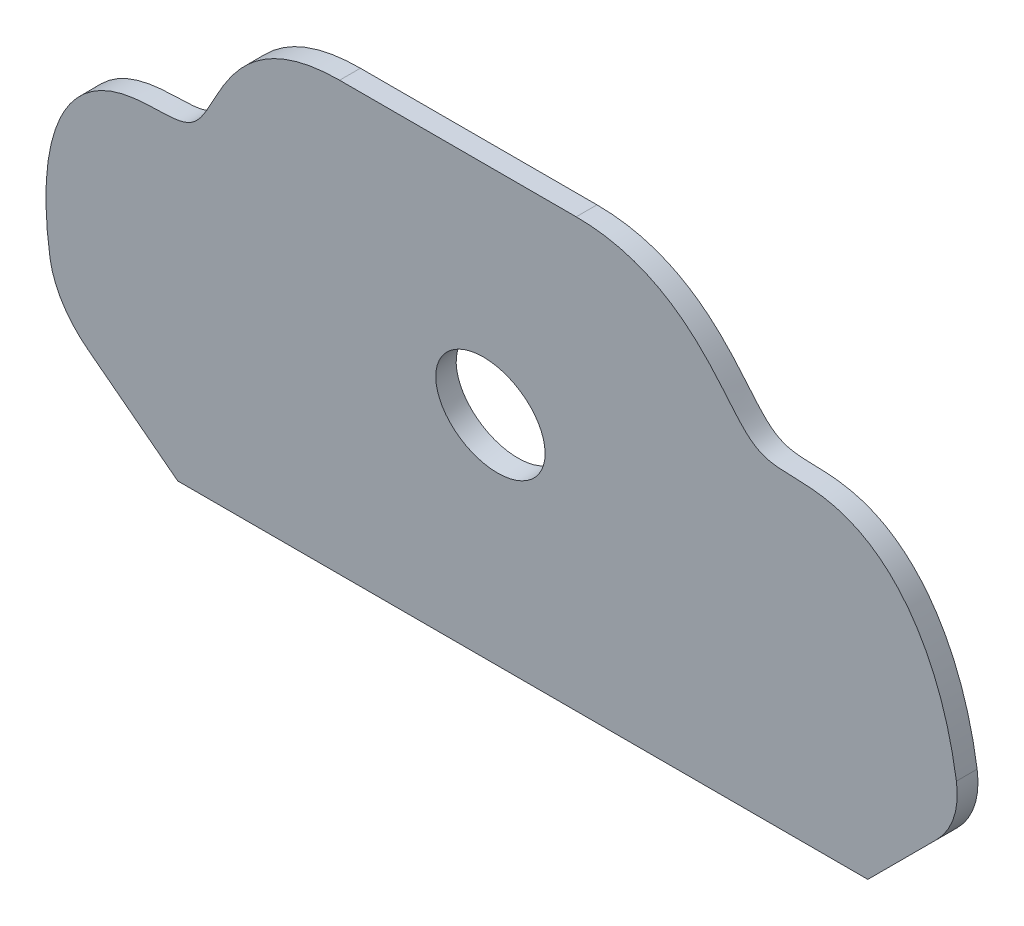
ISO-10303-21;
HEADER;
FILE_DESCRIPTION(('STEP AP214'),'2;1');
FILE_NAME('part.step','',(''),(''),'','','');
FILE_SCHEMA(('AUTOMOTIVE_DESIGN { 1 0 10303 214 1 1 1 1 }'));
ENDSEC;
DATA;
#1=APPLICATION_CONTEXT('core data for automotive mechanical design processes');
#2=APPLICATION_PROTOCOL_DEFINITION('international standard','automotive_design',2000,#1);
#3=PRODUCT_CONTEXT('',#1,'mechanical');
#4=PRODUCT('Part','Part','',(#3));
#5=PRODUCT_RELATED_PRODUCT_CATEGORY('part','',(#4));
#6=PRODUCT_DEFINITION_FORMATION('','',#4);
#7=PRODUCT_DEFINITION_CONTEXT('part definition',#1,'design');
#8=PRODUCT_DEFINITION('design','',#6,#7);
#9=PRODUCT_DEFINITION_SHAPE('','',#8);
#10=(LENGTH_UNIT() NAMED_UNIT(*) SI_UNIT(.MILLI.,.METRE.));
#11=(NAMED_UNIT(*) PLANE_ANGLE_UNIT() SI_UNIT($,.RADIAN.));
#12=(NAMED_UNIT(*) SI_UNIT($,.STERADIAN.) SOLID_ANGLE_UNIT());
#13=UNCERTAINTY_MEASURE_WITH_UNIT(LENGTH_MEASURE(1.E-05),#10,'distance_accuracy_value','');
#14=(GEOMETRIC_REPRESENTATION_CONTEXT(3) GLOBAL_UNCERTAINTY_ASSIGNED_CONTEXT((#13)) GLOBAL_UNIT_ASSIGNED_CONTEXT((#10,
#11,#12)) REPRESENTATION_CONTEXT('',''));
#15=CARTESIAN_POINT('',(0.,0.,0.));
#16=DIRECTION('',(0.,0.,1.));
#17=DIRECTION('',(1.,0.,0.));
#18=AXIS2_PLACEMENT_3D('',#15,#16,#17);
#19=CARTESIAN_POINT('',(175.,0.,25.));
#20=DIRECTION('',(-0.707106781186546,0.707106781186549,0.));
#21=DIRECTION('',(-0.707106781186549,-0.707106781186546,0.));
#22=AXIS2_PLACEMENT_3D('',#19,#20,#21);
#23=PLANE('',#22);
#24=DIRECTION('',(-0.704062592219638,-0.704062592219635,-0.0926915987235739));
#25=VECTOR('',#24,1.);
#26=CARTESIAN_POINT('',(178.049188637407,3.04918863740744,-21.3217742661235));
#27=LINE('',#26,#25);
#28=CARTESIAN_POINT('',(215.218833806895,40.2188338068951,-16.428297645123));
#29=VERTEX_POINT('',#28);
#30=CARTESIAN_POINT('',(175.,0.,-21.7232075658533));
#31=VERTEX_POINT('',#30);
#32=EDGE_CURVE('E107',#29,#31,#27,.T.);
#33=ORIENTED_EDGE('',*,*,#32,.F.);
#34=DIRECTION('',(0.,0.,-1.));
#35=VECTOR('',#34,1.);
#36=CARTESIAN_POINT('',(215.218833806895,40.2188338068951,25.));
#37=LINE('',#36,#35);
#38=CARTESIAN_POINT('',(215.218833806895,40.2188338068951,-5.89500691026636));
#39=VERTEX_POINT('',#38);
#40=EDGE_CURVE('E165',#39,#29,#37,.T.);
#41=ORIENTED_EDGE('',*,*,#40,.F.);
#42=DIRECTION('',(0.704062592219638,0.704062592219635,0.092691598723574));
#43=VECTOR('',#42,1.);
#44=CARTESIAN_POINT('',(177.361778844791,2.36177884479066,-10.8789827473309));
#45=LINE('',#44,#43);
#46=CARTESIAN_POINT('',(175.,0.,-11.1899168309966));
#47=VERTEX_POINT('',#46);
#48=EDGE_CURVE('E179',#47,#39,#45,.T.);
#49=ORIENTED_EDGE('',*,*,#48,.F.);
#50=DIRECTION('',(0.,0.,-1.));
#51=VECTOR('',#50,1.);
#52=CARTESIAN_POINT('',(175.,0.,25.));
#53=LINE('',#52,#51);
#54=EDGE_CURVE('E186',#47,#31,#53,.T.);
#55=ORIENTED_EDGE('',*,*,#54,.T.);
#56=EDGE_LOOP('',(#33,#41,#49,#55));
#57=FACE_BOUND('',#56,.T.);
#58=ADVANCED_FACE('F85',(#57),#23,.F.);
#59=CARTESIAN_POINT('',(179.863494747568,75.5741728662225,25.));
#60=DIRECTION('',(0.,0.,-1.));
#61=DIRECTION('',(-1.,0.,0.));
#62=AXIS2_PLACEMENT_3D('',#59,#60,#61);
#63=CYLINDRICAL_SURFACE('',#62,50.);
#64=CARTESIAN_POINT('',(179.863494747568,75.5741728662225,-11.7736789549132));
#65=DIRECTION('',(0.,0.130526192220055,-0.99144486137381));
#66=DIRECTION('',(0.,-0.99144486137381,-0.130526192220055));
#67=AXIS2_PLACEMENT_3D('',#64,#65,#66);
#68=ELLIPSE('',#67,50.4314480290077,50.);
#69=CARTESIAN_POINT('',(229.863495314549,75.5741720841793,-11.7736790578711));
#70=VERTEX_POINT('',#69);
#71=EDGE_CURVE('E150',#70,#29,#68,.T.);
#72=ORIENTED_EDGE('',*,*,#71,.F.);
#73=DIRECTION('',(0.,0.,-1.));
#74=VECTOR('',#73,1.);
#75=CARTESIAN_POINT('',(229.863494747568,75.5741720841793,25.));
#76=LINE('',#75,#74);
#77=CARTESIAN_POINT('',(229.863495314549,75.5741720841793,-1.24038832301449));
#78=VERTEX_POINT('',#77);
#79=EDGE_CURVE('E163',#78,#70,#76,.T.);
#80=ORIENTED_EDGE('',*,*,#79,.F.);
#81=CARTESIAN_POINT('',(179.863494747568,75.5741728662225,-1.24038822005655));
#82=DIRECTION('',(0.,-0.130526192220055,0.99144486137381));
#83=DIRECTION('',(0.,-0.99144486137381,-0.130526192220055));
#84=AXIS2_PLACEMENT_3D('',#81,#82,#83);
#85=ELLIPSE('',#84,50.4314480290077,50.);
#86=EDGE_CURVE('E188',#39,#78,#85,.T.);
#87=ORIENTED_EDGE('',*,*,#86,.F.);
#88=ORIENTED_EDGE('',*,*,#40,.T.);
#89=EDGE_LOOP('',(#72,#80,#87,#88));
#90=FACE_BOUND('',#89,.T.);
#91=ADVANCED_FACE('F161',(#90),#63,.T.);
#92=CARTESIAN_POINT('',(229.863494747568,75.5741720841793,25.));
#93=CARTESIAN_POINT('',(229.863497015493,220.574172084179,25.));
#94=CARTESIAN_POINT('',(130.657195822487,208.,25.));
#95=CARTESIAN_POINT('',(130.657198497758,108.,25.));
#96=CARTESIAN_POINT('',(160.,250.,25.));
#97=CARTESIAN_POINT('',(60.,250.,25.));
#98=B_SPLINE_CURVE_WITH_KNOTS('',5,(#92,#93,#94,#95,#96,#97),.UNSPECIFIED.,.F.,.F.,(6,6),(0.,
1.),.UNSPECIFIED.);
#99=DIRECTION('',(0.,0.,-1.));
#100=VECTOR('',#99,1.);
#101=SURFACE_OF_LINEAR_EXTRUSION('',#98,#100);
#102=CARTESIAN_POINT('',(60.,250.,11.1899168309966));
#103=CARTESIAN_POINT('',(60.8830126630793,250.000006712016,11.1899177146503));
#104=CARTESIAN_POINT('',(61.7660613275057,249.986713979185,11.1881676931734));
#105=CARTESIAN_POINT('',(63.5324407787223,249.93249252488,11.1810293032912));
#106=CARTESIAN_POINT('',(64.4157704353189,249.891527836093,11.1756361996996));
#107=CARTESIAN_POINT('',(66.181294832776,249.780877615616,11.1610688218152));
#108=CARTESIAN_POINT('',(67.0634881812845,249.711170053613,11.1518916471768));
#109=CARTESIAN_POINT('',(68.8253035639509,249.542062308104,11.1296281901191));
#110=CARTESIAN_POINT('',(69.7049245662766,249.4426515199,11.1165405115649));
#111=CARTESIAN_POINT('',(71.4601740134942,249.213274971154,11.0863425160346));
#112=CARTESIAN_POINT('',(72.3358021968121,249.083307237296,11.0692319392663));
#113=CARTESIAN_POINT('',(74.080387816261,248.792288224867,11.0309185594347));
#114=CARTESIAN_POINT('',(74.9493535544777,248.63128596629,11.0097222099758));
#115=CARTESIAN_POINT('',(76.6804254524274,248.277487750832,10.9631437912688));
#116=CARTESIAN_POINT('',(77.5425335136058,248.084700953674,10.937762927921));
#117=CARTESIAN_POINT('',(79.2585055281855,247.666881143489,10.8827559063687));
#118=CARTESIAN_POINT('',(80.1123718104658,247.44185754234,10.8531309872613));
#119=CARTESIAN_POINT('',(81.8105190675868,246.959257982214,10.7895955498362));
#120=CARTESIAN_POINT('',(82.6548019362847,246.701688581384,10.7556858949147));
#121=CARTESIAN_POINT('',(84.3324679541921,246.153854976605,10.6835622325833));
#122=CARTESIAN_POINT('',(85.1658515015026,245.863591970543,10.6453483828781));
#123=CARTESIAN_POINT('',(86.9758781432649,245.192780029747,10.5570343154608));
#124=CARTESIAN_POINT('',(87.9499990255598,244.805516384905,10.5060500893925));
#125=CARTESIAN_POINT('',(89.8786974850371,243.98536764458,10.3980754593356));
#126=CARTESIAN_POINT('',(90.8332715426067,243.55247441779,10.3410839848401));
#127=CARTESIAN_POINT('',(92.7205581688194,242.642027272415,10.2212213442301));
#128=CARTESIAN_POINT('',(93.6532697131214,242.16447126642,10.158349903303));
#129=CARTESIAN_POINT('',(95.494701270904,241.166093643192,10.0269109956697));
#130=CARTESIAN_POINT('',(96.4034236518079,240.645276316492,9.95834409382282));
#131=CARTESIAN_POINT('',(98.1931889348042,239.563274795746,9.81589589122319));
#132=CARTESIAN_POINT('',(99.0742909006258,239.00218657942,9.74202722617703));
#133=CARTESIAN_POINT('',(100.809604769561,237.840576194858,9.58909831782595));
#134=CARTESIAN_POINT('',(101.663817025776,237.240054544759,9.51003814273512));
#135=CARTESIAN_POINT('',(103.344384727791,236.001759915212,9.34701356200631));
#136=CARTESIAN_POINT('',(104.17073812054,235.363984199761,9.26304879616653));
#137=CARTESIAN_POINT('',(105.794848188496,234.053636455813,9.09053824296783));
#138=CARTESIAN_POINT('',(106.592605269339,233.381064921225,9.00199252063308));
#139=CARTESIAN_POINT('',(108.030805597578,232.11657533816,8.8355193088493));
#140=CARTESIAN_POINT('',(108.675600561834,231.529507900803,8.75823041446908));
#141=CARTESIAN_POINT('',(109.945065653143,230.334297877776,8.60087802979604));
#142=CARTESIAN_POINT('',(110.569734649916,229.72615411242,8.52081438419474));
#143=CARTESIAN_POINT('',(111.799239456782,228.490208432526,8.35809904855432));
#144=CARTESIAN_POINT('',(112.404070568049,227.862401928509,8.2754467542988));
#145=CARTESIAN_POINT('',(113.594145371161,226.58874657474,8.10776684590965));
#146=CARTESIAN_POINT('',(114.179387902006,225.942896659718,8.02273909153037));
#147=CARTESIAN_POINT('',(115.330727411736,224.634741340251,7.85051717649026));
#148=CARTESIAN_POINT('',(115.896825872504,223.972437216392,7.76332318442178));
#149=CARTESIAN_POINT('',(117.010619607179,222.632784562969,7.58695456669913));
#150=CARTESIAN_POINT('',(117.55831451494,221.955435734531,7.49777990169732));
#151=CARTESIAN_POINT('',(118.637798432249,220.585032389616,7.31736287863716));
#152=CARTESIAN_POINT('',(119.169533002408,219.89193577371,7.22611497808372));
#153=CARTESIAN_POINT('',(120.216318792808,218.493516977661,7.04200965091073));
#154=CARTESIAN_POINT('',(120.731370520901,217.788195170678,6.94915227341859));
#155=CARTESIAN_POINT('',(121.745931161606,216.366802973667,6.76202244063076));
#156=CARTESIAN_POINT('',(122.245442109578,215.650734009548,6.6677501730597));
#157=CARTESIAN_POINT('',(123.230371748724,214.209158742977,6.47796318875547));
#158=CARTESIAN_POINT('',(123.715790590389,213.483652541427,6.38244848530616));
#159=CARTESIAN_POINT('',(124.674149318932,212.024606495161,6.19036142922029));
#160=CARTESIAN_POINT('',(125.14708930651,211.291066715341,6.09378908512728));
#161=CARTESIAN_POINT('',(126.082377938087,209.817395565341,5.89977659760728));
#162=CARTESIAN_POINT('',(126.544726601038,209.077264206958,5.80233645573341));
#163=CARTESIAN_POINT('',(127.448969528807,207.611541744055,5.60937043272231));
#164=CARTESIAN_POINT('',(127.891081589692,206.886082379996,5.51386189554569));
#165=CARTESIAN_POINT('',(128.769773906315,205.432016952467,5.32243055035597));
#166=CARTESIAN_POINT('',(129.206354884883,204.703411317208,5.22650779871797));
#167=CARTESIAN_POINT('',(130.077035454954,203.244699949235,5.03446480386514));
#168=CARTESIAN_POINT('',(130.51113491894,202.514594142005,4.93834455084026));
#169=CARTESIAN_POINT('',(131.380510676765,201.054976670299,4.74618226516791));
#170=CARTESIAN_POINT('',(131.815787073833,200.325465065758,4.65014024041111));
#171=CARTESIAN_POINT('',(132.473000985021,199.233756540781,4.50641408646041));
#172=CARTESIAN_POINT('',(132.692784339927,198.870287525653,4.45856248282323));
#173=CARTESIAN_POINT('',(133.134485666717,198.144627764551,4.36302756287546));
#174=CARTESIAN_POINT('',(133.3564036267,197.782437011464,4.31534424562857));
#175=CARTESIAN_POINT('',(133.803127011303,197.059848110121,4.22021361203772));
#176=CARTESIAN_POINT('',(134.027932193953,196.699449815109,4.17276627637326));
#177=CARTESIAN_POINT('',(134.481325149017,195.981002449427,4.0781808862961));
#178=CARTESIAN_POINT('',(134.709912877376,195.622953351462,4.0310428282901));
#179=CARTESIAN_POINT('',(135.232122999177,194.816873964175,3.92492046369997));
#180=CARTESIAN_POINT('',(135.527154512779,194.369737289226,3.86605380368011));
#181=CARTESIAN_POINT('',(136.127121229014,193.48198110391,3.74917848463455));
#182=CARTESIAN_POINT('',(136.432056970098,193.041361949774,3.69116987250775));
#183=CARTESIAN_POINT('',(137.05460514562,192.168724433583,3.57628496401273));
#184=CARTESIAN_POINT('',(137.372222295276,191.736709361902,3.51940910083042));
#185=CARTESIAN_POINT('',(138.022673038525,190.884858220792,3.40726077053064));
#186=CARTESIAN_POINT('',(138.355487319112,190.465007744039,3.35198640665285));
#187=CARTESIAN_POINT('',(139.039929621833,189.640761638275,3.2434723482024));
#188=CARTESIAN_POINT('',(139.391552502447,189.236361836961,3.19023210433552));
#189=CARTESIAN_POINT('',(140.116994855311,188.447744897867,3.08640871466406));
#190=CARTESIAN_POINT('',(140.490804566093,188.063519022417,3.0358244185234));
#191=CARTESIAN_POINT('',(141.136525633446,187.443062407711,2.95413975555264));
#192=CARTESIAN_POINT('',(141.40149894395,187.199731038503,2.92210457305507));
#193=CARTESIAN_POINT('',(141.943486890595,186.726594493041,2.85981496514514));
#194=CARTESIAN_POINT('',(142.220500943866,186.496788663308,2.82956045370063));
#195=CARTESIAN_POINT('',(142.786872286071,186.052672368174,2.77109143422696));
#196=CARTESIAN_POINT('',(143.076228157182,185.838360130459,2.74287669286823));
#197=CARTESIAN_POINT('',(143.665576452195,185.42815638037,2.68887234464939));
#198=CARTESIAN_POINT('',(143.965501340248,185.232169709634,2.66307020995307));
#199=CARTESIAN_POINT('',(144.576936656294,184.858731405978,2.613906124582));
#200=CARTESIAN_POINT('',(144.888448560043,184.681282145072,2.59054448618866));
#201=CARTESIAN_POINT('',(145.521934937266,184.345909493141,2.54639183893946));
#202=CARTESIAN_POINT('',(145.843908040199,184.187983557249,2.52560049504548));
#203=CARTESIAN_POINT('',(146.495846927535,183.892409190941,2.4866873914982));
#204=CARTESIAN_POINT('',(146.825781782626,183.754693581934,2.46855678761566));
#205=CARTESIAN_POINT('',(147.49317814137,183.498460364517,2.43482304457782));
#206=CARTESIAN_POINT('',(147.83064070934,183.379945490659,2.41922026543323));
#207=CARTESIAN_POINT('',(148.511467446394,183.16109653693,2.39040825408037));
#208=CARTESIAN_POINT('',(148.854831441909,183.060761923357,2.37719895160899));
#209=CARTESIAN_POINT('',(149.549084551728,182.875942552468,2.35286701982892));
#210=CARTESIAN_POINT('',(149.900013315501,182.791605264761,2.34176380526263));
#211=CARTESIAN_POINT('',(150.605135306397,182.6380395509,2.32154649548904));
#212=CARTESIAN_POINT('',(150.959328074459,182.56880903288,2.31243212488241));
#213=CARTESIAN_POINT('',(151.669922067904,182.443474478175,2.29593151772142));
#214=CARTESIAN_POINT('',(152.02632254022,182.387366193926,2.28854472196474));
#215=CARTESIAN_POINT('',(152.795691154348,182.278475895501,2.2742090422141));
#216=CARTESIAN_POINT('',(153.208921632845,182.227535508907,2.26750261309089));
#217=CARTESIAN_POINT('',(154.036713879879,182.137538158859,2.25565423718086));
#218=CARTESIAN_POINT('',(154.451275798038,182.098482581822,2.2505124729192));
#219=CARTESIAN_POINT('',(155.28120428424,182.029604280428,2.24144447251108));
#220=CARTESIAN_POINT('',(155.69657093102,181.999782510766,2.2375183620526));
#221=CARTESIAN_POINT('',(156.527719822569,181.947005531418,2.23057014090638));
#222=CARTESIAN_POINT('',(156.943502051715,181.924050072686,2.227547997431));
#223=CARTESIAN_POINT('',(157.775927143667,181.882878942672,2.22212771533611));
#224=CARTESIAN_POINT('',(158.192570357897,181.86467048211,2.21973052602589));
#225=CARTESIAN_POINT('',(159.025975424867,181.831192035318,2.21532300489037));
#226=CARTESIAN_POINT('',(159.442737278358,181.815922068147,2.21331267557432));
#227=CARTESIAN_POINT('',(160.276881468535,181.786681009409,2.20946301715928));
#228=CARTESIAN_POINT('',(160.69426386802,181.772711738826,2.20762392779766));
#229=CARTESIAN_POINT('',(161.529023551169,181.744667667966,2.20393185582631));
#230=CARTESIAN_POINT('',(161.946400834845,181.730592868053,2.20207887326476));
#231=CARTESIAN_POINT('',(162.781514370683,181.701062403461,2.19819111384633));
#232=CARTESIAN_POINT('',(163.199250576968,181.6856054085,2.19615616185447));
#233=CARTESIAN_POINT('',(164.034621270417,181.652209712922,2.19175953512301));
#234=CARTESIAN_POINT('',(164.452255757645,181.634271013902,2.18939786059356));
#235=CARTESIAN_POINT('',(165.705585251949,181.575178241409,2.18161814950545));
#236=CARTESIAN_POINT('',(166.541047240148,181.528767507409,2.17550806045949));
#237=CARTESIAN_POINT('',(168.198899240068,181.415960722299,2.160656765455));
#238=CARTESIAN_POINT('',(169.021308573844,181.349853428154,2.15195357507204));
#239=CARTESIAN_POINT('',(170.663980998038,181.192232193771,2.13120234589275));
#240=CARTESIAN_POINT('',(171.484243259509,181.100709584,2.1191531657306));
#241=CARTESIAN_POINT('',(173.120426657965,180.888136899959,2.09116744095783));
#242=CARTESIAN_POINT('',(173.936350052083,180.767104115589,2.07523317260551));
#243=CARTESIAN_POINT('',(175.561820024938,180.49230414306,2.03905506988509));
#244=CARTESIAN_POINT('',(176.371371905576,180.338568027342,2.01881532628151));
#245=CARTESIAN_POINT('',(177.982194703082,179.995927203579,1.97370580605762));
#246=CARTESIAN_POINT('',(178.783471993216,179.80705208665,1.94883992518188));
#247=CARTESIAN_POINT('',(180.375971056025,179.392354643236,1.89424397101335));
#248=CARTESIAN_POINT('',(181.167196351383,179.166545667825,1.86451565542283));
#249=CARTESIAN_POINT('',(182.658674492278,178.701492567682,1.80329025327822));
#250=CARTESIAN_POINT('',(183.360079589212,178.465878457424,1.77227106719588));
#251=CARTESIAN_POINT('',(184.751621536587,177.963512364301,1.70613331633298));
#252=CARTESIAN_POINT('',(185.441756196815,177.696754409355,1.67101396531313));
#253=CARTESIAN_POINT('',(186.809028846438,177.132220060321,1.59669160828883));
#254=CARTESIAN_POINT('',(187.486166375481,176.834442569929,1.55748845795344));
#255=CARTESIAN_POINT('',(188.825878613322,176.208353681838,1.47506229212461));
#256=CARTESIAN_POINT('',(189.488454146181,175.880044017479,1.43183950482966));
#257=CARTESIAN_POINT('',(190.804249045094,175.19023206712,1.34102403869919));
#258=CARTESIAN_POINT('',(191.457309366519,174.828431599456,1.29339210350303));
#259=CARTESIAN_POINT('',(192.746034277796,174.075527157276,1.19427035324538));
#260=CARTESIAN_POINT('',(193.381698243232,173.684422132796,1.14278039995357));
#261=CARTESIAN_POINT('',(194.634625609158,172.874193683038,1.03611180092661));
#262=CARTESIAN_POINT('',(195.251888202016,172.455069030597,0.980932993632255));
#263=CARTESIAN_POINT('',(196.467130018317,171.590315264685,0.867086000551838));
#264=CARTESIAN_POINT('',(197.06511053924,171.14468794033,0.808418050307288));
#265=CARTESIAN_POINT('',(198.429749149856,170.081602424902,0.668460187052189));
#266=CARTESIAN_POINT('',(199.189055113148,169.454841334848,0.585945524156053));
#267=CARTESIAN_POINT('',(200.672230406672,168.161517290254,0.415676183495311));
#268=CARTESIAN_POINT('',(201.396100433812,167.494955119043,0.327921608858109));
#269=CARTESIAN_POINT('',(202.808144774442,166.125764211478,0.147664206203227));
#270=CARTESIAN_POINT('',(203.496320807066,165.423137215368,0.055161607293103));
#271=CARTESIAN_POINT('',(204.83468263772,163.988086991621,-0.133766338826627));
#272=CARTESIAN_POINT('',(205.485000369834,163.255784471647,-0.230175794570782));
#273=CARTESIAN_POINT('',(206.750941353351,161.762313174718,-0.426795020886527));
#274=CARTESIAN_POINT('',(207.366564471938,161.001144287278,-0.527004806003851));
#275=CARTESIAN_POINT('',(208.563963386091,159.45299584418,-0.730822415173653));
#276=CARTESIAN_POINT('',(209.145735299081,158.666013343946,-0.834430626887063));
#277=CARTESIAN_POINT('',(210.417921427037,156.869209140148,-1.07098438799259));
#278=CARTESIAN_POINT('',(211.099065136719,155.852929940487,-1.20478008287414));
#279=CARTESIAN_POINT('',(212.41225818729,153.789252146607,-1.4764684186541));
#280=CARTESIAN_POINT('',(213.04428951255,152.741842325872,-1.61436253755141));
#281=CARTESIAN_POINT('',(214.261591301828,150.62015589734,-1.8936878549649));
#282=CARTESIAN_POINT('',(214.846843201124,149.545868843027,-2.03512042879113));
#283=CARTESIAN_POINT('',(215.972691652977,147.374607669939,-2.32097238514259));
#284=CARTESIAN_POINT('',(216.513288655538,146.277633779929,-2.46539173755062));
#285=CARTESIAN_POINT('',(217.557030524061,144.053931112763,-2.75814774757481));
#286=CARTESIAN_POINT('',(218.059780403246,142.927020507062,-2.90650834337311));
#287=CARTESIAN_POINT('',(219.024406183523,140.656579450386,-3.20541757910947));
#288=CARTESIAN_POINT('',(219.486294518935,139.513054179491,-3.35596553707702));
#289=CARTESIAN_POINT('',(220.371567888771,137.211582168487,-3.65896007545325));
#290=CARTESIAN_POINT('',(220.794956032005,136.053636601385,-3.81140650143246));
#291=CARTESIAN_POINT('',(221.605333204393,133.725441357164,-4.11791922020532));
#292=CARTESIAN_POINT('',(221.992325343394,132.555192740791,-4.27198537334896));
#293=CARTESIAN_POINT('',(222.841183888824,129.856772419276,-4.62723914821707));
#294=CARTESIAN_POINT('',(223.291396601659,128.324992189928,-4.82890184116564));
#295=CARTESIAN_POINT('',(224.138124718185,125.24672343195,-5.2341636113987));
#296=CARTESIAN_POINT('',(224.53463147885,123.700232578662,-5.43776299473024));
#297=CARTESIAN_POINT('',(225.277646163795,120.594626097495,-5.84662384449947));
#298=CARTESIAN_POINT('',(225.624126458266,119.035503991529,-6.05188616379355));
#299=CARTESIAN_POINT('',(226.270291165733,115.906657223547,-6.46380665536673));
#300=CARTESIAN_POINT('',(226.569942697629,114.336925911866,-6.67046570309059));
#301=CARTESIAN_POINT('',(227.125275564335,111.188798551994,-7.08492453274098));
#302=CARTESIAN_POINT('',(227.380927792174,109.610397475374,-7.29272497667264));
#303=CARTESIAN_POINT('',(227.850789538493,106.446810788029,-7.70921906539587));
#304=CARTESIAN_POINT('',(228.064979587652,104.86162234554,-7.9179130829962));
#305=CARTESIAN_POINT('',(228.447738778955,101.739067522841,-8.3290052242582));
#306=CARTESIAN_POINT('',(228.617582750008,100.201853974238,-8.53138322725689));
#307=CARTESIAN_POINT('',(228.922578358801,97.1244376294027,-8.93653277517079));
#308=CARTESIAN_POINT('',(229.057738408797,95.5842356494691,-9.13930421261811));
#309=CARTESIAN_POINT('',(229.295130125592,92.5025496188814,-9.54501587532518));
#310=CARTESIAN_POINT('',(229.397387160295,90.9610674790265,-9.74795584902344));
#311=CARTESIAN_POINT('',(229.57063516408,87.8785204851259,-10.153780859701));
#312=CARTESIAN_POINT('',(229.641669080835,86.3374579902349,-10.3566655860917));
#313=CARTESIAN_POINT('',(229.754062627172,83.2574521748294,-10.7621560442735));
#314=CARTESIAN_POINT('',(229.795482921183,81.7185110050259,-10.9647614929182));
#315=CARTESIAN_POINT('',(229.850150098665,78.6444277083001,-11.3694722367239));
#316=CARTESIAN_POINT('',(229.863475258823,77.109286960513,-11.5715773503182));
#317=CARTESIAN_POINT('',(229.863494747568,75.5741720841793,-11.7736790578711));
#318=B_SPLINE_CURVE_WITH_KNOTS('',3,(#102,#103,#104,#105,#106,#107,#108,#109,#110,#111,#112,
#113,#114,#115,#116,#117,#118,#119,#120,#121,#122,#123,#124,#125,#126,#127,#128,#129,#130,#131,
#132,#133,#134,#135,#136,#137,#138,#139,#140,#141,#142,#143,#144,#145,#146,#147,#148,#149,#150,
#151,#152,#153,#154,#155,#156,#157,#158,#159,#160,#161,#162,#163,#164,#165,#166,#167,#168,#169,
#170,#171,#172,#173,#174,#175,#176,#177,#178,#179,#180,#181,#182,#183,#184,#185,#186,#187,#188,
#189,#190,#191,#192,#193,#194,#195,#196,#197,#198,#199,#200,#201,#202,#203,#204,#205,#206,#207,
#208,#209,#210,#211,#212,#213,#214,#215,#216,#217,#218,#219,#220,#221,#222,#223,#224,#225,#226,
#227,#228,#229,#230,#231,#232,#233,#234,#235,#236,#237,#238,#239,#240,#241,#242,#243,#244,#245,
#246,#247,#248,#249,#250,#251,#252,#253,#254,#255,#256,#257,#258,#259,#260,#261,#262,#263,#264,
#265,#266,#267,#268,#269,#270,#271,#272,#273,#274,#275,#276,#277,#278,#279,#280,#281,#282,#283,
#284,#285,#286,#287,#288,#289,#290,#291,#292,#293,#294,#295,#296,#297,#298,#299,#300,#301,#302,
#303,#304,#305,#306,#307,#308,#309,#310,#311,#312,#313,#314,#315,#316,#317),.UNSPECIFIED.,.F.,
.F.,(4,2,2,2,2,2,2,2,2,2,2,2,2,2,2,2,2,2,2,2,2,2,2,2,2,2,2,2,2,2,2,2,2,2,2,2,2,2,2,2,2,2,2,2,2,
2,2,2,2,2,2,2,2,2,2,2,2,2,2,2,2,2,2,2,2,2,2,2,2,2,2,2,2,2,2,2,2,2,2,2,2,2,2,2,2,2,2,2,2,2,2,2,2,
2,2,2,2,2,2,2,2,2,2,2,2,2,2,4),(0.,2.64898945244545,5.3014286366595,7.95590460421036,
10.6113294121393,13.2669257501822,15.9183613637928,18.5690342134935,21.218934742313,
23.868302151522,26.5175725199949,29.6649041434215,32.8127975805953,35.9608382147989,
39.1085670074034,42.2490281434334,45.3894480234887,48.5300988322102,51.6707050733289,
54.2965145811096,56.9224712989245,59.5490455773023,62.1757752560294,64.8023011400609,
67.4288792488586,70.0635817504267,72.6982039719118,75.3324796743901,77.9667272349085,
80.6009535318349,83.2351751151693,85.7998788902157,88.3642439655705,90.9287396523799,
93.4934680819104,94.775780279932,96.0580853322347,97.3402836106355,98.6224669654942,
100.239141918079,101.855904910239,103.473274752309,105.088643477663,106.703572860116,
108.317796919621,109.400929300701,110.484009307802,111.566965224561,112.643942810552,
113.721058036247,114.798032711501,115.871342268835,116.944804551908,118.018235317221,
119.101125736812,120.183866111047,121.266255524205,122.515265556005,123.764421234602,
125.013706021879,126.262945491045,127.514071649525,128.765205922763,130.018066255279,
131.270922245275,132.52499728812,133.779071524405,136.289197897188,138.76419830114,
141.240044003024,143.714442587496,146.186500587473,148.656486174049,151.125580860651,
153.346571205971,155.567988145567,157.789483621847,160.010853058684,162.254360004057,
164.497947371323,166.741633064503,168.98516746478,171.947635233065,174.910044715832,
177.87231138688,180.823546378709,183.774792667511,186.726376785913,190.416994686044,
194.108960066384,197.802383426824,201.495769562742,205.22349841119,208.950088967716,
212.676378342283,216.402349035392,221.229024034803,226.05647488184,230.886581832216,
235.720065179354,240.556733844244,245.395668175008,250.074519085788,254.752234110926,
259.426333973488,264.093984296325,268.752045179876,273.397110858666),.UNSPECIFIED.);
#319=CARTESIAN_POINT('',(60.,250.,11.1899168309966));
#320=VERTEX_POINT('',#319);
#321=EDGE_CURVE('E147',#320,#70,#318,.T.);
#322=ORIENTED_EDGE('',*,*,#321,.F.);
#323=DIRECTION('',(0.,0.,-1.));
#324=VECTOR('',#323,1.);
#325=CARTESIAN_POINT('',(60.,250.,25.));
#326=LINE('',#325,#324);
#327=CARTESIAN_POINT('',(60.,250.,21.7232075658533));
#328=VERTEX_POINT('',#327);
#329=EDGE_CURVE('E170',#328,#320,#326,.T.);
#330=ORIENTED_EDGE('',*,*,#329,.F.);
#331=CARTESIAN_POINT('',(229.863494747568,75.5741720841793,-1.24038832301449));
#332=CARTESIAN_POINT('',(229.8634777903,77.0583355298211,-1.04499449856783));
#333=CARTESIAN_POINT('',(229.851021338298,78.5425214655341,-0.849597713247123));
#334=CARTESIAN_POINT('',(229.799972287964,81.5139654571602,-0.458399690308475));
#335=CARTESIAN_POINT('',(229.761317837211,83.0012224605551,-0.262598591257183));
#336=CARTESIAN_POINT('',(229.656513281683,85.9773804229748,0.129220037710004));
#337=CARTESIAN_POINT('',(229.590315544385,87.4662797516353,0.325237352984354));
#338=CARTESIAN_POINT('',(229.428982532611,90.4442741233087,0.717297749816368));
#339=CARTESIAN_POINT('',(229.333813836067,91.9333673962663,0.913340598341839));
#340=CARTESIAN_POINT('',(229.113033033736,94.9103022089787,1.30526150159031));
#341=CARTESIAN_POINT('',(228.987401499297,96.3981423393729,1.50113937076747));
#342=CARTESIAN_POINT('',(228.704099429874,99.3711165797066,1.89253885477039));
#343=CARTESIAN_POINT('',(228.546422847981,100.856250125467,2.08806039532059));
#344=CARTESIAN_POINT('',(228.194570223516,103.84577397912,2.48163867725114));
#345=CARTESIAN_POINT('',(227.999862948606,105.350103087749,2.67968736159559));
#346=CARTESIAN_POINT('',(227.573685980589,108.35303776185,3.07503121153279));
#347=CARTESIAN_POINT('',(227.342231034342,109.851645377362,3.27232664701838));
#348=CARTESIAN_POINT('',(226.840435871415,112.841614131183,3.66596350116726));
#349=CARTESIAN_POINT('',(226.570117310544,114.332978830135,3.86230538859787));
#350=CARTESIAN_POINT('',(225.988247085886,117.306898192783,4.25382930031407));
#351=CARTESIAN_POINT('',(225.676719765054,118.789457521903,4.44901193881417));
#352=CARTESIAN_POINT('',(225.009807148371,121.744140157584,4.8380032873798));
#353=CARTESIAN_POINT('',(224.654442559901,123.216268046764,5.03181260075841));
#354=CARTESIAN_POINT('',(223.896872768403,126.148434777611,5.41783967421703));
#355=CARTESIAN_POINT('',(223.494675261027,127.608475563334,5.61005769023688));
#356=CARTESIAN_POINT('',(222.772249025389,130.065038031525,5.93347027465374));
#357=CARTESIAN_POINT('',(222.465104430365,131.065353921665,6.06516435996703));
#358=CARTESIAN_POINT('',(221.825736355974,133.058149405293,6.32752086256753));
#359=CARTESIAN_POINT('',(221.493511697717,134.050628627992,6.45818323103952));
#360=CARTESIAN_POINT('',(220.80278055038,136.026589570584,6.71832342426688));
#361=CARTESIAN_POINT('',(220.444273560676,137.010071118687,6.84780122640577));
#362=CARTESIAN_POINT('',(219.69965732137,138.966849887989,7.10541603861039));
#363=CARTESIAN_POINT('',(219.313545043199,139.940145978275,7.23355289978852));
#364=CARTESIAN_POINT('',(218.513295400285,141.872827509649,7.48799525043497));
#365=CARTESIAN_POINT('',(218.099222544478,142.832239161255,7.61430419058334));
#366=CARTESIAN_POINT('',(217.240873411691,144.737735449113,7.86516753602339));
#367=CARTESIAN_POINT('',(216.796596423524,145.683819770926,7.98972189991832));
#368=CARTESIAN_POINT('',(215.876436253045,147.560672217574,8.23681421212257));
#369=CARTESIAN_POINT('',(215.400556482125,148.491441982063,8.3593523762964));
#370=CARTESIAN_POINT('',(214.415700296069,150.335555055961,8.6021344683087));
#371=CARTESIAN_POINT('',(213.906724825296,151.248898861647,8.72237846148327));
#372=CARTESIAN_POINT('',(212.482304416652,153.694167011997,9.04430412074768));
#373=CARTESIAN_POINT('',(211.533697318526,155.207321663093,9.24351470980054));
#374=CARTESIAN_POINT('',(209.52828854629,158.162108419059,9.63251976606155));
#375=CARTESIAN_POINT('',(208.471484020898,159.603738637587,9.82231398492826));
#376=CARTESIAN_POINT('',(206.801771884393,161.698137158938,10.0980467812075));
#377=CARTESIAN_POINT('',(206.231481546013,162.384540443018,10.1884134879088));
#378=CARTESIAN_POINT('',(205.061985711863,163.732643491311,10.3658946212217));
#379=CARTESIAN_POINT('',(204.462783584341,164.394346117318,10.4530094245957));
#380=CARTESIAN_POINT('',(203.235164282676,165.690416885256,10.6236403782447));
#381=CARTESIAN_POINT('',(202.60675098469,166.324788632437,10.7071570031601));
#382=CARTESIAN_POINT('',(201.320622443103,167.563496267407,10.8702359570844));
#383=CARTESIAN_POINT('',(200.662911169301,168.167836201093,10.949798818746));
#384=CARTESIAN_POINT('',(199.287179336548,169.371010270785,11.1081996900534));
#385=CARTESIAN_POINT('',(198.567776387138,169.968293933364,11.1868335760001));
#386=CARTESIAN_POINT('',(197.097771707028,171.123768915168,11.3389547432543));
#387=CARTESIAN_POINT('',(196.347172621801,171.681963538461,11.4124424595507));
#388=CARTESIAN_POINT('',(194.815926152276,172.756213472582,11.5538701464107));
#389=CARTESIAN_POINT('',(194.035280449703,173.272271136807,11.6218104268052));
#390=CARTESIAN_POINT('',(192.446079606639,174.259182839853,11.7517398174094));
#391=CARTESIAN_POINT('',(191.637541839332,174.73006435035,11.813732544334));
#392=CARTESIAN_POINT('',(189.99427229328,175.62467011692,11.931509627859));
#393=CARTESIAN_POINT('',(189.159538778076,176.048391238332,11.9872935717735));
#394=CARTESIAN_POINT('',(187.466638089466,176.846916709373,12.0924214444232));
#395=CARTESIAN_POINT('',(186.608472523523,177.221724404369,12.1417658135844));
#396=CARTESIAN_POINT('',(185.089750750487,177.833727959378,12.2223376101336));
#397=CARTESIAN_POINT('',(184.433645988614,178.081854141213,12.255004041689));
#398=CARTESIAN_POINT('',(183.11132181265,178.55019696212,12.3166625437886));
#399=CARTESIAN_POINT('',(182.445101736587,178.770411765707,12.3456543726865));
#400=CARTESIAN_POINT('',(181.104051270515,179.183197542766,12.399998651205));
#401=CARTESIAN_POINT('',(180.429221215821,179.375769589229,12.4253512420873));
#402=CARTESIAN_POINT('',(179.0723452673,179.733938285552,12.4725050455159));
#403=CARTESIAN_POINT('',(178.390299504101,179.899535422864,12.4943063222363));
#404=CARTESIAN_POINT('',(177.020758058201,180.204695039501,12.5344813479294));
#405=CARTESIAN_POINT('',(176.33326589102,180.344273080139,12.5528571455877));
#406=CARTESIAN_POINT('',(174.953695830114,180.598931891,12.5863836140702));
#407=CARTESIAN_POINT('',(174.261617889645,180.71401241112,12.6015342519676));
#408=CARTESIAN_POINT('',(172.874094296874,180.921483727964,12.6288483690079));
#409=CARTESIAN_POINT('',(172.178648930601,181.013876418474,12.6410120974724));
#410=CARTESIAN_POINT('',(170.785346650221,181.178230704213,12.6626497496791));
#411=CARTESIAN_POINT('',(170.087489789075,181.250192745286,12.6721237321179));
#412=CARTESIAN_POINT('',(168.746106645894,181.371364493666,12.6880762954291));
#413=CARTESIAN_POINT('',(168.102703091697,181.421934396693,12.6947339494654));
#414=CARTESIAN_POINT('',(166.815106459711,181.510621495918,12.7064098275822));
#415=CARTESIAN_POINT('',(166.170913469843,181.548739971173,12.7114282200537));
#416=CARTESIAN_POINT('',(164.881914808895,181.615523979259,12.7202205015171));
#417=CARTESIAN_POINT('',(164.237109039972,181.644187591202,12.7239941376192));
#418=CARTESIAN_POINT('',(162.947086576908,181.695610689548,12.7307641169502));
#419=CARTESIAN_POINT('',(162.301869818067,181.718368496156,12.7337602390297));
#420=CARTESIAN_POINT('',(161.008916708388,181.762314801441,12.7395458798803));
#421=CARTESIAN_POINT('',(160.361180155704,181.783496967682,12.7423345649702));
#422=CARTESIAN_POINT('',(159.06594861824,181.829416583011,12.7483799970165));
#423=CARTESIAN_POINT('',(158.418453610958,181.854153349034,12.7516366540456));
#424=CARTESIAN_POINT('',(157.124173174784,181.913560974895,12.759457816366));
#425=CARTESIAN_POINT('',(156.477387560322,181.948227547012,12.764021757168));
#426=CARTESIAN_POINT('',(155.185026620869,182.035319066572,12.7754875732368));
#427=CARTESIAN_POINT('',(154.539451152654,182.087741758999,12.7823891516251));
#428=CARTESIAN_POINT('',(153.2681339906,182.218053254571,12.7995449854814));
#429=CARTESIAN_POINT('',(152.64232092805,182.295228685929,12.8097053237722));
#430=CARTESIAN_POINT('',(151.39594147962,182.485559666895,12.8347628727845));
#431=CARTESIAN_POINT('',(150.775375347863,182.598716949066,12.8496603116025));
#432=CARTESIAN_POINT('',(149.855397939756,182.802706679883,12.8765160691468));
#433=CARTESIAN_POINT('',(149.552003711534,182.875973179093,12.8861617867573));
#434=CARTESIAN_POINT('',(148.948614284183,183.035111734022,12.9071127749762));
#435=CARTESIAN_POINT('',(148.648618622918,183.120982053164,12.9184178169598));
#436=CARTESIAN_POINT('',(148.052948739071,183.306361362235,12.942823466));
#437=CARTESIAN_POINT('',(147.757274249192,183.405869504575,12.9559239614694));
#438=CARTESIAN_POINT('',(147.171296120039,183.619289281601,12.9840212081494));
#439=CARTESIAN_POINT('',(146.880991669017,183.733198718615,12.9990176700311));
#440=CARTESIAN_POINT('',(146.301594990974,183.978055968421,13.0312537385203));
#441=CARTESIAN_POINT('',(146.012618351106,184.109273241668,13.04852882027));
#442=CARTESIAN_POINT('',(145.44222514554,184.387196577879,13.08511812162));
#443=CARTESIAN_POINT('',(145.160811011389,184.533907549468,13.1044329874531));
#444=CARTESIAN_POINT('',(144.606507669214,184.842410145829,13.1450481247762));
#445=CARTESIAN_POINT('',(144.333618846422,185.004202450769,13.166348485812));
#446=CARTESIAN_POINT('',(143.797097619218,185.34204641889,13.21082648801));
#447=CARTESIAN_POINT('',(143.533462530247,185.518093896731,13.2340035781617));
#448=CARTESIAN_POINT('',(143.013554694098,185.884952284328,13.2823014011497));
#449=CARTESIAN_POINT('',(142.75736166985,186.075874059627,13.3074367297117));
#450=CARTESIAN_POINT('',(142.25470978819,186.469903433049,13.3593116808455));
#451=CARTESIAN_POINT('',(142.008251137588,186.673011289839,13.3860513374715));
#452=CARTESIAN_POINT('',(141.524846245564,187.090061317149,13.4409570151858));
#453=CARTESIAN_POINT('',(141.287900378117,187.304003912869,13.4691230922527));
#454=CARTESIAN_POINT('',(140.823226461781,187.741258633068,13.5266887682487));
#455=CARTESIAN_POINT('',(140.595494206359,187.964566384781,13.5560877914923));
#456=CARTESIAN_POINT('',(139.867749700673,188.705088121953,13.6535793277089));
#457=CARTESIAN_POINT('',(139.385054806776,189.239132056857,13.7238875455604));
#458=CARTESIAN_POINT('',(138.687623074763,190.062079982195,13.8322306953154));
#459=CARTESIAN_POINT('',(138.459505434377,190.340144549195,13.8688385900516));
#460=CARTESIAN_POINT('',(138.011085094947,190.902413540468,13.9428627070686));
#461=CARTESIAN_POINT('',(137.790782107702,191.186617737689,13.9802788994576));
#462=CARTESIAN_POINT('',(137.356425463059,191.760883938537,14.0558824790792));
#463=CARTESIAN_POINT('',(137.142390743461,192.050959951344,14.0940717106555));
#464=CARTESIAN_POINT('',(136.720263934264,192.635340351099,14.1710068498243));
#465=CARTESIAN_POINT('',(136.512172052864,192.929644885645,14.2097527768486));
#466=CARTESIAN_POINT('',(136.100528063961,193.522527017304,14.2878071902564));
#467=CARTESIAN_POINT('',(135.896989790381,193.821114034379,14.3271169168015));
#468=CARTESIAN_POINT('',(135.494254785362,194.421156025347,14.4061139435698));
#469=CARTESIAN_POINT('',(135.295058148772,194.72261106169,14.4458012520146));
#470=CARTESIAN_POINT('',(134.702312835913,195.631355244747,14.5654396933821));
#471=CARTESIAN_POINT('',(134.314216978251,196.242137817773,14.6458507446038));
#472=CARTESIAN_POINT('',(133.547815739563,197.469407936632,14.807423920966));
#473=CARTESIAN_POINT('',(133.169507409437,198.085893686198,14.8885858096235));
#474=CARTESIAN_POINT('',(132.41313594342,199.331390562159,15.0525585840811));
#475=CARTESIAN_POINT('',(132.035158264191,199.960452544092,15.1353761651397));
#476=CARTESIAN_POINT('',(131.282664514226,201.218735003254,15.3010321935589));
#477=CARTESIAN_POINT('',(130.908142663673,201.847952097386,15.3838701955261));
#478=CARTESIAN_POINT('',(130.15964159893,203.105343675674,15.549408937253));
#479=CARTESIAN_POINT('',(129.785662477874,203.733518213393,15.6321096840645));
#480=CARTESIAN_POINT('',(129.035815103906,204.987906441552,15.7972530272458));
#481=CARTESIAN_POINT('',(128.659949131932,205.614121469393,15.8796957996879));
#482=CARTESIAN_POINT('',(127.904246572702,206.863880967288,16.0442297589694));
#483=CARTESIAN_POINT('',(127.524411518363,207.48742634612,16.1263210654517));
#484=CARTESIAN_POINT('',(126.758952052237,208.731284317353,16.2900780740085));
#485=CARTESIAN_POINT('',(126.37332586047,209.35159583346,16.3717436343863));
#486=CARTESIAN_POINT('',(125.336915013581,210.997880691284,16.5884811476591));
#487=CARTESIAN_POINT('',(124.679906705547,212.020024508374,16.7230489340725));
#488=CARTESIAN_POINT('',(123.340630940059,214.04928676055,16.9902063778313));
#489=CARTESIAN_POINT('',(122.658341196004,215.056390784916,17.1227941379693));
#490=CARTESIAN_POINT('',(121.264668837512,217.051221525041,17.385418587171));
#491=CARTESIAN_POINT('',(120.553275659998,218.038941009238,17.5154543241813));
#492=CARTESIAN_POINT('',(119.098112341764,219.991037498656,17.7724527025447));
#493=CARTESIAN_POINT('',(118.35433540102,220.955409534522,17.89941468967));
#494=CARTESIAN_POINT('',(116.83151865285,222.857135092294,18.1497816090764));
#495=CARTESIAN_POINT('',(116.052463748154,223.7944767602,18.273184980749));
#496=CARTESIAN_POINT('',(114.464418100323,225.629496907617,18.5147699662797));
#497=CARTESIAN_POINT('',(113.655756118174,226.527454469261,18.6329883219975));
#498=CARTESIAN_POINT('',(112.000407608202,228.288697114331,18.8648603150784));
#499=CARTESIAN_POINT('',(111.153712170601,229.151973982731,18.9785128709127));
#500=CARTESIAN_POINT('',(109.421941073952,230.839269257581,19.2006495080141));
#501=CARTESIAN_POINT('',(108.536879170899,231.663301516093,19.3091354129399));
#502=CARTESIAN_POINT('',(106.728413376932,233.267915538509,19.5203868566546));
#503=CARTESIAN_POINT('',(105.80503171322,234.048521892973,19.6231556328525));
#504=CARTESIAN_POINT('',(103.920305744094,235.562512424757,19.8224762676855));
#505=CARTESIAN_POINT('',(102.958979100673,236.295918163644,19.9190309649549));
#506=CARTESIAN_POINT('',(101.204922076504,237.563449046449,20.0859045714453));
#507=CARTESIAN_POINT('',(100.419168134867,238.107085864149,20.157475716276));
#508=CARTESIAN_POINT('',(98.8253303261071,239.161096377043,20.296238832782));
#509=CARTESIAN_POINT('',(98.0172480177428,239.671472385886,20.3634311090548));
#510=CARTESIAN_POINT('',(96.37986395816,240.657446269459,20.4932370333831));
#511=CARTESIAN_POINT('',(95.5505639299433,241.133046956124,20.5558510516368));
#512=CARTESIAN_POINT('',(93.8719937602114,242.048227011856,20.6763367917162));
#513=CARTESIAN_POINT('',(93.0227239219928,242.487806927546,20.7342085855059));
#514=CARTESIAN_POINT('',(91.3040938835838,243.330702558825,20.8451779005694));
#515=CARTESIAN_POINT('',(90.4346991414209,243.733949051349,20.8982663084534));
#516=CARTESIAN_POINT('',(88.6789482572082,244.502513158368,20.9994496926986));
#517=CARTESIAN_POINT('',(87.792590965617,244.867828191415,21.0475443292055));
#518=CARTESIAN_POINT('',(86.0047647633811,245.560012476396,21.1386721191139));
#519=CARTESIAN_POINT('',(85.1032961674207,245.886882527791,21.1817053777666));
#520=CARTESIAN_POINT('',(83.2871871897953,246.501956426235,21.2626813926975));
#521=CARTESIAN_POINT('',(82.3725488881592,246.790166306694,21.3006249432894));
#522=CARTESIAN_POINT('',(80.7571025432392,247.262249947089,21.3627759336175));
#523=CARTESIAN_POINT('',(80.0587387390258,247.454397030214,21.388072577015));
#524=CARTESIAN_POINT('',(78.6563121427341,247.816864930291,21.4357923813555));
#525=CARTESIAN_POINT('',(77.9522497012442,247.987187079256,21.4582157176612));
#526=CARTESIAN_POINT('',(76.5391279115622,248.306247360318,21.5002208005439));
#527=CARTESIAN_POINT('',(75.8300682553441,248.454984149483,21.5198023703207));
#528=CARTESIAN_POINT('',(74.4076512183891,248.731176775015,21.5561638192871));
#529=CARTESIAN_POINT('',(73.6942932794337,248.858629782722,21.5729433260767));
#530=CARTESIAN_POINT('',(72.2639935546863,249.092608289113,21.603747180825));
#531=CARTESIAN_POINT('',(71.5470512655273,249.199130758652,21.6177711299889));
#532=CARTESIAN_POINT('',(70.1108984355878,249.391571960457,21.6431064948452));
#533=CARTESIAN_POINT('',(69.3916899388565,249.47750571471,21.6544198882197));
#534=CARTESIAN_POINT('',(67.9511502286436,249.62933111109,21.6744080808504));
#535=CARTESIAN_POINT('',(67.229819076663,249.695223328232,21.6830829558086));
#536=CARTESIAN_POINT('',(65.7857553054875,249.80746037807,21.6978592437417));
#537=CARTESIAN_POINT('',(65.0630229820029,249.853808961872,21.7039611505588));
#538=CARTESIAN_POINT('',(63.616883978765,249.927492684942,21.7136617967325));
#539=CARTESIAN_POINT('',(62.8934777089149,249.954835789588,21.7172615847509));
#540=CARTESIAN_POINT('',(61.4467086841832,249.991084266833,21.722033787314));
#541=CARTESIAN_POINT('',(60.723346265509,250.000002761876,21.7232079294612));
#542=CARTESIAN_POINT('',(60.,250.,21.7232075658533));
#543=B_SPLINE_CURVE_WITH_KNOTS('',3,(#331,#332,#333,#334,#335,#336,#337,#338,#339,#340,#341,
#342,#343,#344,#345,#346,#347,#348,#349,#350,#351,#352,#353,#354,#355,#356,#357,#358,#359,#360,
#361,#362,#363,#364,#365,#366,#367,#368,#369,#370,#371,#372,#373,#374,#375,#376,#377,#378,#379,
#380,#381,#382,#383,#384,#385,#386,#387,#388,#389,#390,#391,#392,#393,#394,#395,#396,#397,#398,
#399,#400,#401,#402,#403,#404,#405,#406,#407,#408,#409,#410,#411,#412,#413,#414,#415,#416,#417,
#418,#419,#420,#421,#422,#423,#424,#425,#426,#427,#428,#429,#430,#431,#432,#433,#434,#435,#436,
#437,#438,#439,#440,#441,#442,#443,#444,#445,#446,#447,#448,#449,#450,#451,#452,#453,#454,#455,
#456,#457,#458,#459,#460,#461,#462,#463,#464,#465,#466,#467,#468,#469,#470,#471,#472,#473,#474,
#475,#476,#477,#478,#479,#480,#481,#482,#483,#484,#485,#486,#487,#488,#489,#490,#491,#492,#493,
#494,#495,#496,#497,#498,#499,#500,#501,#502,#503,#504,#505,#506,#507,#508,#509,#510,#511,#512,
#513,#514,#515,#516,#517,#518,#519,#520,#521,#522,#523,#524,#525,#526,#527,#528,#529,#530,#531,
#532,#533,#534,#535,#536,#537,#538,#539,#540,#541,#542),.UNSPECIFIED.,.F.,.F.,(4,2,2,2,2,2,2,2,
2,2,2,2,2,2,2,2,2,2,2,2,2,2,2,2,2,2,2,2,2,2,2,2,2,2,2,2,2,2,2,2,2,2,2,2,2,2,2,2,2,2,2,2,2,2,2,2,
2,2,2,2,2,2,2,2,2,2,2,2,2,2,2,2,2,2,2,2,2,2,2,2,2,2,2,2,2,2,2,2,2,2,2,2,2,2,2,2,2,2,2,2,2,2,2,2,
2,4),(0.,4.49089279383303,8.99242551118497,13.5017756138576,18.0163477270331,22.5338067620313,
27.052119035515,31.640947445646,36.2279389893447,40.8123843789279,45.3941336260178,
49.9737268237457,54.5525685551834,57.7162660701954,60.8801123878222,64.0440189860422,
67.2082732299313,70.3654613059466,73.5227237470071,76.6796459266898,79.8364780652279,
85.2231815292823,90.6100269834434,93.3002485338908,95.9901574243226,98.679710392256,
101.368900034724,104.182600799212,106.996063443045,109.809368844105,112.620952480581,
115.432722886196,118.244300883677,120.350340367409,122.456518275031,124.562614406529,
126.668672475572,128.773466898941,130.87828280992,132.982922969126,135.08751719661,
137.023637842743,138.959559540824,140.895874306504,142.832739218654,144.777009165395,
146.720905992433,148.663964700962,150.606776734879,152.497986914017,154.389288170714,
155.325851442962,156.262285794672,157.198661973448,158.134895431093,159.087957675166,
160.041322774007,160.994730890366,161.947860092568,162.908937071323,163.870034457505,
164.831169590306,165.791860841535,167.959325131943,169.04381992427,170.128274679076,
171.215724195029,172.303211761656,173.393646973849,174.484105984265,176.668265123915,
178.851758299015,181.067368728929,183.278112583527,185.485310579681,187.690286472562,
189.894440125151,192.099285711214,195.766544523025,199.437116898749,203.109033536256,
206.781724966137,210.456003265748,214.097528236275,217.739910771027,221.380997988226,
225.020001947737,228.657331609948,231.531020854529,234.404509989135,237.277766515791,
240.150979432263,243.029555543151,245.908327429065,248.787039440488,251.665301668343,
253.839232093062,256.013029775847,258.18696264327,260.361184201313,262.535720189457,
264.708664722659,266.881546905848,269.054011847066,271.225565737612,273.395572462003),.UNSPECIFIED.);
#544=EDGE_CURVE('E169',#78,#328,#543,.T.);
#545=ORIENTED_EDGE('',*,*,#544,.F.);
#546=ORIENTED_EDGE('',*,*,#79,.T.);
#547=EDGE_LOOP('',(#322,#330,#545,#546));
#548=FACE_BOUND('',#547,.T.);
#549=ADVANCED_FACE('F168',(#548),#101,.F.);
#550=CARTESIAN_POINT('',(-60.,250.,25.));
#551=DIRECTION('',(0.,-1.,0.));
#552=DIRECTION('',(0.,0.,-1.));
#553=AXIS2_PLACEMENT_3D('',#550,#551,#552);
#554=PLANE('',#553);
#555=DIRECTION('',(1.,0.,0.));
#556=VECTOR('',#555,1.);
#557=CARTESIAN_POINT('',(-60.,250.,11.1899168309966));
#558=LINE('',#557,#556);
#559=CARTESIAN_POINT('',(-60.,250.,11.1899168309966));
#560=VERTEX_POINT('',#559);
#561=EDGE_CURVE('E152',#560,#320,#558,.T.);
#562=ORIENTED_EDGE('',*,*,#561,.F.);
#563=DIRECTION('',(0.,0.,-1.));
#564=VECTOR('',#563,1.);
#565=CARTESIAN_POINT('',(-60.,250.,25.));
#566=LINE('',#565,#564);
#567=CARTESIAN_POINT('',(-60.,250.,21.7232075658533));
#568=VERTEX_POINT('',#567);
#569=EDGE_CURVE('E173',#568,#560,#566,.T.);
#570=ORIENTED_EDGE('',*,*,#569,.F.);
#571=DIRECTION('',(-1.,0.,0.));
#572=VECTOR('',#571,1.);
#573=CARTESIAN_POINT('',(-60.,250.,21.7232075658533));
#574=LINE('',#573,#572);
#575=EDGE_CURVE('E218',#328,#568,#574,.T.);
#576=ORIENTED_EDGE('',*,*,#575,.F.);
#577=ORIENTED_EDGE('',*,*,#329,.T.);
#578=EDGE_LOOP('',(#562,#570,#576,#577));
#579=FACE_BOUND('',#578,.T.);
#580=ADVANCED_FACE('F217',(#579),#554,.F.);
#581=CARTESIAN_POINT('',(-60.,250.,25.));
#582=CARTESIAN_POINT('',(-160.,250.,25.));
#583=CARTESIAN_POINT('',(-130.657198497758,108.,25.));
#584=CARTESIAN_POINT('',(-130.657195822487,208.,25.));
#585=CARTESIAN_POINT('',(-229.863497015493,220.574172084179,25.));
#586=CARTESIAN_POINT('',(-229.863494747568,75.5741720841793,25.));
#587=B_SPLINE_CURVE_WITH_KNOTS('',5,(#581,#582,#583,#584,#585,#586),.UNSPECIFIED.,.F.,.F.,(6,6),
(0.,1.),.UNSPECIFIED.);
#588=DIRECTION('',(0.,0.,-1.));
#589=VECTOR('',#588,1.);
#590=SURFACE_OF_LINEAR_EXTRUSION('',#587,#589);
#591=CARTESIAN_POINT('',(-229.863494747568,75.5741720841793,-11.7736790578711));
#592=CARTESIAN_POINT('',(-229.863476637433,77.082228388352,-11.5751396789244));
#593=CARTESIAN_POINT('',(-229.850616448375,78.5903087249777,-11.3765971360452));
#594=CARTESIAN_POINT('',(-229.79788777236,81.6098111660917,-10.9790720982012));
#595=CARTESIAN_POINT('',(-229.757951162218,83.1212320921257,-10.780089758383));
#596=CARTESIAN_POINT('',(-229.649632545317,86.1458840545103,-10.3818867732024));
#597=CARTESIAN_POINT('',(-229.581198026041,87.6591132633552,-10.1826663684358));
#598=CARTESIAN_POINT('',(-229.414359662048,90.6858286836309,-9.78419172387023));
#599=CARTESIAN_POINT('',(-229.315918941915,92.1993129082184,-9.58493774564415));
#600=CARTESIAN_POINT('',(-229.087476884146,95.2249860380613,-9.18660032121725));
#601=CARTESIAN_POINT('',(-228.95745410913,96.7371733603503,-8.9875170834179));
#602=CARTESIAN_POINT('',(-228.664161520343,99.7586931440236,-8.58972645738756));
#603=CARTESIAN_POINT('',(-228.500885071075,101.268024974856,-8.39101915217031));
#604=CARTESIAN_POINT('',(-228.136870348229,104.302382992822,-7.99153834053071));
#605=CARTESIAN_POINT('',(-227.935667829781,105.827354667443,-7.79077201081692));
#606=CARTESIAN_POINT('',(-227.495227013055,108.871244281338,-7.39003634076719));
#607=CARTESIAN_POINT('',(-227.256004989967,110.390164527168,-7.1900666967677));
#608=CARTESIAN_POINT('',(-226.73729095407,113.420330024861,-6.79113784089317));
#609=CARTESIAN_POINT('',(-226.457822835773,114.931579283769,-6.59217810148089));
#610=CARTESIAN_POINT('',(-225.85614135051,117.94473745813,-6.19548830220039));
#611=CARTESIAN_POINT('',(-225.533954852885,119.44665162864,-5.99775755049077));
#612=CARTESIAN_POINT('',(-224.844063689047,122.439405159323,-5.60375407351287));
#613=CARTESIAN_POINT('',(-224.476381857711,123.930249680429,-5.40748066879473));
#614=CARTESIAN_POINT('',(-223.692339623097,126.899101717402,-5.01662388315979));
#615=CARTESIAN_POINT('',(-223.275987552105,128.377111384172,-4.82204021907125));
#616=CARTESIAN_POINT('',(-222.539079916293,130.826148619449,-4.49961835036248));
#617=CARTESIAN_POINT('',(-222.233029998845,131.801482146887,-4.37121325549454));
#618=CARTESIAN_POINT('',(-221.596728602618,133.744426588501,-4.11541976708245));
#619=CARTESIAN_POINT('',(-221.266476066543,134.712037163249,-3.98803141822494));
#620=CARTESIAN_POINT('',(-220.580640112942,136.638404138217,-3.73442039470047));
#621=CARTESIAN_POINT('',(-220.225056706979,137.59716054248,-3.60819771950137));
#622=CARTESIAN_POINT('',(-219.487322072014,139.504665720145,-3.35706989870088));
#623=CARTESIAN_POINT('',(-219.10516899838,140.45341379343,-3.23216484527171));
#624=CARTESIAN_POINT('',(-218.31320180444,142.339073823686,-2.98391299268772));
#625=CARTESIAN_POINT('',(-217.903398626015,143.275990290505,-2.86056559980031));
#626=CARTESIAN_POINT('',(-217.054659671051,145.13681966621,-2.61558276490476));
#627=CARTESIAN_POINT('',(-216.615722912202,146.06073213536,-2.49394738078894));
#628=CARTESIAN_POINT('',(-215.707371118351,147.893707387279,-2.25263161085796));
#629=CARTESIAN_POINT('',(-215.237957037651,148.802770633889,-2.13295116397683));
#630=CARTESIAN_POINT('',(-214.267206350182,150.604111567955,-1.8958001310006));
#631=CARTESIAN_POINT('',(-213.765866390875,151.496387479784,-1.77832977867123));
#632=CARTESIAN_POINT('',(-212.545962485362,153.575220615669,-1.50464620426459));
#633=CARTESIAN_POINT('',(-211.813465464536,154.75379845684,-1.34948348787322));
#634=CARTESIAN_POINT('',(-210.283950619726,157.069214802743,-1.04465314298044));
#635=CARTESIAN_POINT('',(-209.486930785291,158.206052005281,-0.894985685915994));
#636=CARTESIAN_POINT('',(-207.825109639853,160.430568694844,-0.602122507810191));
#637=CARTESIAN_POINT('',(-206.960292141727,161.518236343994,-0.458928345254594));
#638=CARTESIAN_POINT('',(-205.16362000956,163.631844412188,-0.180666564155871));
#639=CARTESIAN_POINT('',(-204.231991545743,164.657973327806,-0.0455741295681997));
#640=CARTESIAN_POINT('',(-202.297944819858,166.642553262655,0.215700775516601));
#641=CARTESIAN_POINT('',(-201.295538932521,167.601016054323,0.341884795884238));
#642=CARTESIAN_POINT('',(-199.739619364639,168.979774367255,0.523401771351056));
#643=CARTESIAN_POINT('',(-199.212375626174,169.429450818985,0.582602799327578));
#644=CARTESIAN_POINT('',(-198.140569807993,170.308012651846,0.69826765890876));
#645=CARTESIAN_POINT('',(-197.596008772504,170.736899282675,0.7547316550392));
#646=CARTESIAN_POINT('',(-196.296012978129,171.719097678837,0.88404052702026));
#647=CARTESIAN_POINT('',(-195.533567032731,172.263331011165,0.955690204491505));
#648=CARTESIAN_POINT('',(-193.979188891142,173.30844613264,1.09328222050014));
#649=CARTESIAN_POINT('',(-193.187261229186,173.809334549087,1.15922543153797));
#650=CARTESIAN_POINT('',(-191.575768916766,174.765153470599,1.28506137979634));
#651=CARTESIAN_POINT('',(-190.75620737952,175.220089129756,1.34495479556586));
#652=CARTESIAN_POINT('',(-189.093413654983,176.081067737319,1.45830477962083));
#653=CARTESIAN_POINT('',(-188.250231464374,176.487205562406,1.51177383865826));
#654=CARTESIAN_POINT('',(-186.541408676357,177.25023956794,1.61222917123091));
#655=CARTESIAN_POINT('',(-185.675765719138,177.607130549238,1.65921476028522));
#656=CARTESIAN_POINT('',(-183.925236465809,178.271057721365,1.74662243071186));
#657=CARTESIAN_POINT('',(-183.040350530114,178.578094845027,1.78704463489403));
#658=CARTESIAN_POINT('',(-181.640605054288,179.020749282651,1.84532119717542));
#659=CARTESIAN_POINT('',(-181.131059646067,179.173113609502,1.86538034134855));
#660=CARTESIAN_POINT('',(-180.107470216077,179.46217022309,1.90343536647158));
#661=CARTESIAN_POINT('',(-179.59342632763,179.598862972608,1.92143130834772));
#662=CARTESIAN_POINT('',(-178.561346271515,179.856955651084,1.95540985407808));
#663=CARTESIAN_POINT('',(-178.043309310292,179.9783524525,1.9713920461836));
#664=CARTESIAN_POINT('',(-177.003949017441,180.20630248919,2.001402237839));
#665=CARTESIAN_POINT('',(-176.482625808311,180.31285627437,2.01543030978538));
#666=CARTESIAN_POINT('',(-175.43728144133,180.511726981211,2.04161213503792));
#667=CARTESIAN_POINT('',(-174.913260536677,180.60404521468,2.05376606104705));
#668=CARTESIAN_POINT('',(-173.863003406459,180.775198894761,2.07629887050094));
#669=CARTESIAN_POINT('',(-173.336767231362,180.854034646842,2.08667779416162));
#670=CARTESIAN_POINT('',(-172.279757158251,180.999491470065,2.10582754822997));
#671=CARTESIAN_POINT('',(-171.748973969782,181.066045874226,2.11458960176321));
#672=CARTESIAN_POINT('',(-170.686058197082,181.187470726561,2.13057548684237));
#673=CARTESIAN_POINT('',(-170.153925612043,181.24234116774,2.13779931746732));
#674=CARTESIAN_POINT('',(-169.088717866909,181.341604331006,2.15086756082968));
#675=CARTESIAN_POINT('',(-168.555642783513,181.385997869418,2.15671208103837));
#676=CARTESIAN_POINT('',(-167.488801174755,181.465704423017,2.16720564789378));
#677=CARTESIAN_POINT('',(-166.955034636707,181.501017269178,2.1718546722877));
#678=CARTESIAN_POINT('',(-165.88712905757,181.564154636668,2.18016686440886));
#679=CARTESIAN_POINT('',(-165.352990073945,181.591980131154,2.1838301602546));
#680=CARTESIAN_POINT('',(-164.284449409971,181.641986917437,2.19041367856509));
#681=CARTESIAN_POINT('',(-163.750047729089,181.664168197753,2.19333389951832));
#682=CARTESIAN_POINT('',(-162.672960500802,181.705322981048,2.19875202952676));
#683=CARTESIAN_POINT('',(-162.13027293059,181.724242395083,2.20124281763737));
#684=CARTESIAN_POINT('',(-161.044926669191,181.761043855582,2.20608782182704));
#685=CARTESIAN_POINT('',(-160.502267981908,181.77892602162,2.20844205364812));
#686=CARTESIAN_POINT('',(-159.41684458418,181.816708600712,2.21341622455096));
#687=CARTESIAN_POINT('',(-158.874079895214,181.836609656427,2.21603624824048));
#688=CARTESIAN_POINT('',(-157.788325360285,181.88205262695,2.22201892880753));
#689=CARTESIAN_POINT('',(-157.24533570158,181.907599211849,2.22538220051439));
#690=CARTESIAN_POINT('',(-156.162818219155,181.968452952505,2.23339374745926));
#691=CARTESIAN_POINT('',(-155.623287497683,182.003706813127,2.23803500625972));
#692=CARTESIAN_POINT('',(-154.545476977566,182.089016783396,2.24926627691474));
#693=CARTESIAN_POINT('',(-154.007196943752,182.1390698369,2.25585588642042));
#694=CARTESIAN_POINT('',(-152.933466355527,182.259710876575,2.2717385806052));
#695=CARTESIAN_POINT('',(-152.398013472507,182.330277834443,2.28102889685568));
#696=CARTESIAN_POINT('',(-151.33154454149,182.4984063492,2.30316343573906));
#697=CARTESIAN_POINT('',(-150.800526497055,182.595955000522,2.31600595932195));
#698=CARTESIAN_POINT('',(-149.888658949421,182.793751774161,2.34204639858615));
#699=CARTESIAN_POINT('',(-149.506078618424,182.886117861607,2.35420662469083));
#700=CARTESIAN_POINT('',(-148.746418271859,183.091170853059,2.38120236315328));
#701=CARTESIAN_POINT('',(-148.369338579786,183.203858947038,2.39603803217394));
#702=CARTESIAN_POINT('',(-147.622712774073,183.451486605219,2.42863883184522));
#703=CARTESIAN_POINT('',(-147.253165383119,183.586422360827,2.44640346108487));
#704=CARTESIAN_POINT('',(-146.525512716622,183.879029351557,2.48492590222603));
#705=CARTESIAN_POINT('',(-146.167358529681,184.036580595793,2.50566791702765));
#706=CARTESIAN_POINT('',(-145.462455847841,184.375232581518,2.55025229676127));
#707=CARTESIAN_POINT('',(-145.115709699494,184.556338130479,2.5740952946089));
#708=CARTESIAN_POINT('',(-144.435402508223,184.941318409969,2.62477890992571));
#709=CARTESIAN_POINT('',(-144.101839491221,185.14518971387,2.65161907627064));
#710=CARTESIAN_POINT('',(-143.450453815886,185.573118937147,2.70795702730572));
#711=CARTESIAN_POINT('',(-143.132564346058,185.797077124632,2.73744168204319));
#712=CARTESIAN_POINT('',(-142.511185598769,186.263876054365,2.7988969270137));
#713=CARTESIAN_POINT('',(-142.207698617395,186.506719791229,2.83086791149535));
#714=CARTESIAN_POINT('',(-141.614931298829,187.008832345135,2.89697228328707));
#715=CARTESIAN_POINT('',(-141.325651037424,187.268101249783,2.93110568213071));
#716=CARTESIAN_POINT('',(-140.758408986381,187.802651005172,3.00148049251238));
#717=CARTESIAN_POINT('',(-140.48054988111,188.078038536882,3.03773594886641));
#718=CARTESIAN_POINT('',(-139.937455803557,188.640647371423,3.11180480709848));
#719=CARTESIAN_POINT('',(-139.672218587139,188.927866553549,3.14961792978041));
#720=CARTESIAN_POINT('',(-139.153116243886,189.512054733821,3.22652776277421));
#721=CARTESIAN_POINT('',(-138.899247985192,189.809021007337,3.2656241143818));
#722=CARTESIAN_POINT('',(-138.375521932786,190.442416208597,3.34901217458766));
#723=CARTESIAN_POINT('',(-138.106757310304,190.779731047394,3.39342051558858));
#724=CARTESIAN_POINT('',(-137.579612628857,191.462268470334,3.48327827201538));
#725=CARTESIAN_POINT('',(-137.321233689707,191.807491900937,3.52872779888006));
#726=CARTESIAN_POINT('',(-136.813182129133,192.504323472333,3.6204674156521));
#727=CARTESIAN_POINT('',(-136.563512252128,192.855933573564,3.66675776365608));
#728=CARTESIAN_POINT('',(-136.071494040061,193.564121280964,3.75999244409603));
#729=CARTESIAN_POINT('',(-135.82914546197,193.920698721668,3.80693675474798));
#730=CARTESIAN_POINT('',(-135.349991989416,194.638449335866,3.90143041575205));
#731=CARTESIAN_POINT('',(-135.113198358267,194.999629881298,3.94898073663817));
#732=CARTESIAN_POINT('',(-134.644451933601,195.725061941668,4.04448567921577));
#733=CARTESIAN_POINT('',(-134.412499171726,196.089313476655,4.09244030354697));
#734=CARTESIAN_POINT('',(-133.951998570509,196.820807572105,4.18874332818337));
#735=CARTESIAN_POINT('',(-133.723457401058,197.188054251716,4.23709227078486));
#736=CARTESIAN_POINT('',(-133.26928526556,197.924314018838,4.33402270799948));
#737=CARTESIAN_POINT('',(-133.043654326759,198.293327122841,4.38260420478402));
#738=CARTESIAN_POINT('',(-132.369465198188,199.402941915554,4.52868776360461));
#739=CARTESIAN_POINT('',(-131.924048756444,200.145416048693,4.62643633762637));
#740=CARTESIAN_POINT('',(-131.036235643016,201.632053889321,4.82215592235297));
#741=CARTESIAN_POINT('',(-130.59383876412,202.376217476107,4.92012691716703));
#742=CARTESIAN_POINT('',(-129.706536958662,203.865997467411,5.11626017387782));
#743=CARTESIAN_POINT('',(-129.261628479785,204.611611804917,5.21442216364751));
#744=CARTESIAN_POINT('',(-128.367664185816,206.099263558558,5.41027523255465));
#745=CARTESIAN_POINT('',(-127.918613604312,206.841304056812,5.5079667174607));
#746=CARTESIAN_POINT('',(-127.013511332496,208.320229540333,5.70267095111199));
#747=CARTESIAN_POINT('',(-126.557466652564,209.057118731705,5.79968425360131));
#748=CARTESIAN_POINT('',(-125.635948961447,210.524426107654,5.99285893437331));
#749=CARTESIAN_POINT('',(-125.170482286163,211.254848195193,6.08902082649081));
#750=CARTESIAN_POINT('',(-124.227995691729,212.708095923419,6.28034451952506));
#751=CARTESIAN_POINT('',(-123.750978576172,213.430923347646,6.37550655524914));
#752=CARTESIAN_POINT('',(-122.783482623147,214.867984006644,6.56469918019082));
#753=CARTESIAN_POINT('',(-122.29299988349,215.582214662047,6.6587294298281));
#754=CARTESIAN_POINT('',(-121.19044587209,217.152660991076,6.8654826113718));
#755=CARTESIAN_POINT('',(-120.574865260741,218.00646280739,6.97788775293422));
#756=CARTESIAN_POINT('',(-119.319419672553,219.697051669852,7.20045799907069));
#757=CARTESIAN_POINT('',(-118.679542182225,220.533829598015,7.31062190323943));
#758=CARTESIAN_POINT('',(-117.373889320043,222.187567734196,7.5283406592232));
#759=CARTESIAN_POINT('',(-116.708109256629,223.004524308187,7.63589503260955));
#760=CARTESIAN_POINT('',(-115.349245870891,224.615977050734,7.84804681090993));
#761=CARTESIAN_POINT('',(-114.656159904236,225.41047103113,7.95264392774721));
#762=CARTESIAN_POINT('',(-113.24144896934,226.974494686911,8.15855154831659));
#763=CARTESIAN_POINT('',(-112.519816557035,227.74401775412,8.25986118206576));
#764=CARTESIAN_POINT('',(-111.048992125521,229.253582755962,8.45859918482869));
#765=CARTESIAN_POINT('',(-110.299862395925,229.993684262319,8.55603539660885));
#766=CARTESIAN_POINT('',(-108.77204126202,231.443589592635,8.74691905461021));
#767=CARTESIAN_POINT('',(-107.993344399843,232.153387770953,8.84036575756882));
#768=CARTESIAN_POINT('',(-106.406631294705,233.539733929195,9.02288169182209));
#769=CARTESIAN_POINT('',(-105.598620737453,234.216288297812,9.11195176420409));
#770=CARTESIAN_POINT('',(-103.953760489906,235.533464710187,9.28536132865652));
#771=CARTESIAN_POINT('',(-103.116920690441,236.174098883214,9.36970241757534));
#772=CARTESIAN_POINT('',(-101.415106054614,237.41703496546,9.53333805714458));
#773=CARTESIAN_POINT('',(-100.55013950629,238.019348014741,9.6126340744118));
#774=CARTESIAN_POINT('',(-98.8777994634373,239.127357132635,9.75850624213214));
#775=CARTESIAN_POINT('',(-98.0729274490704,239.636767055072,9.82557133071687));
#776=CARTESIAN_POINT('',(-96.4420598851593,240.621089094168,9.9551597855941));
#777=CARTESIAN_POINT('',(-95.6160657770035,241.096003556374,10.0176834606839));
#778=CARTESIAN_POINT('',(-93.9442486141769,242.010058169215,10.1380210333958));
#779=CARTESIAN_POINT('',(-93.098426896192,242.449200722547,10.1958352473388));
#780=CARTESIAN_POINT('',(-91.3883890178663,243.290707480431,10.3066217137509));
#781=CARTESIAN_POINT('',(-90.5241732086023,243.693072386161,10.3595940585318));
#782=CARTESIAN_POINT('',(-88.7785373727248,244.460453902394,10.4606217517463));
#783=CARTESIAN_POINT('',(-87.8971092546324,244.825452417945,10.5086747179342));
#784=CARTESIAN_POINT('',(-86.1191434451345,245.517417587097,10.5997736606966));
#785=CARTESIAN_POINT('',(-85.2226049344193,245.844382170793,10.6428193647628));
#786=CARTESIAN_POINT('',(-83.4163011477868,246.460052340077,10.7238738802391));
#787=CARTESIAN_POINT('',(-82.5065362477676,246.748759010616,10.7618828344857));
#788=CARTESIAN_POINT('',(-80.6757403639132,247.287961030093,10.832870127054));
#789=CARTESIAN_POINT('',(-79.7547114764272,247.538463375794,10.8658493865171));
#790=CARTESIAN_POINT('',(-78.0601281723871,247.962372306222,10.9216580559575));
#791=CARTESIAN_POINT('',(-77.2880595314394,248.141648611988,10.9452602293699));
#792=CARTESIAN_POINT('',(-75.7383857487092,248.474446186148,10.989073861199));
#793=CARTESIAN_POINT('',(-74.9607812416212,248.62797035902,11.0092857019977));
#794=CARTESIAN_POINT('',(-73.4009074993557,248.909711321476,11.0463776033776));
#795=CARTESIAN_POINT('',(-72.6186381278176,249.037927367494,11.0632575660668));
#796=CARTESIAN_POINT('',(-71.0503058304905,249.269567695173,11.0937535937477));
#797=CARTESIAN_POINT('',(-70.2642425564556,249.372989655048,11.1073693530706));
#798=CARTESIAN_POINT('',(-68.6904572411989,249.555471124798,11.1313934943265));
#799=CARTESIAN_POINT('',(-67.9027395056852,249.634567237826,11.1418066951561));
#800=CARTESIAN_POINT('',(-66.3252934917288,249.769246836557,11.1595376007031));
#801=CARTESIAN_POINT('',(-65.5355652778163,249.824831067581,11.166855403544));
#802=CARTESIAN_POINT('',(-63.9549853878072,249.913166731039,11.1784850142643));
#803=CARTESIAN_POINT('',(-63.1641339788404,249.945922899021,11.1827974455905));
#804=CARTESIAN_POINT('',(-61.5821804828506,249.989336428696,11.1885129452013));
#805=CARTESIAN_POINT('',(-60.7910786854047,250.000004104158,11.1899173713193));
#806=CARTESIAN_POINT('',(-60.,250.,11.1899168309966));
#807=B_SPLINE_CURVE_WITH_KNOTS('',3,(#591,#592,#593,#594,#595,#596,#597,#598,#599,#600,#601,
#602,#603,#604,#605,#606,#607,#608,#609,#610,#611,#612,#613,#614,#615,#616,#617,#618,#619,#620,
#621,#622,#623,#624,#625,#626,#627,#628,#629,#630,#631,#632,#633,#634,#635,#636,#637,#638,#639,
#640,#641,#642,#643,#644,#645,#646,#647,#648,#649,#650,#651,#652,#653,#654,#655,#656,#657,#658,
#659,#660,#661,#662,#663,#664,#665,#666,#667,#668,#669,#670,#671,#672,#673,#674,#675,#676,#677,
#678,#679,#680,#681,#682,#683,#684,#685,#686,#687,#688,#689,#690,#691,#692,#693,#694,#695,#696,
#697,#698,#699,#700,#701,#702,#703,#704,#705,#706,#707,#708,#709,#710,#711,#712,#713,#714,#715,
#716,#717,#718,#719,#720,#721,#722,#723,#724,#725,#726,#727,#728,#729,#730,#731,#732,#733,#734,
#735,#736,#737,#738,#739,#740,#741,#742,#743,#744,#745,#746,#747,#748,#749,#750,#751,#752,#753,
#754,#755,#756,#757,#758,#759,#760,#761,#762,#763,#764,#765,#766,#767,#768,#769,#770,#771,#772,
#773,#774,#775,#776,#777,#778,#779,#780,#781,#782,#783,#784,#785,#786,#787,#788,#789,#790,#791,
#792,#793,#794,#795,#796,#797,#798,#799,#800,#801,#802,#803,#804,#805,#806),.UNSPECIFIED.,.F.,
.F.,(4,2,2,2,2,2,2,2,2,2,2,2,2,2,2,2,2,2,2,2,2,2,2,2,2,2,2,2,2,2,2,2,2,2,2,2,2,2,2,2,2,2,2,2,2,
2,2,2,2,2,2,2,2,2,2,2,2,2,2,2,2,2,2,2,2,2,2,2,2,2,2,2,2,2,2,2,2,2,2,2,2,2,2,2,2,2,2,2,2,2,2,2,2,
2,2,2,2,2,2,2,2,2,2,2,2,2,2,4),(0.,4.56318968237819,9.13790298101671,13.7210835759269,
18.3099194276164,22.9018788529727,27.4947554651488,32.1480084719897,36.799274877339,
41.4477910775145,46.093397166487,50.7366809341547,55.3791709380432,58.4696670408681,
61.5602982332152,64.6509280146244,67.7417725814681,70.8314011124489,73.921133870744,
77.0107699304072,80.1007309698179,84.2876297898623,88.4746591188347,92.6626911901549,
96.83716029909,101.010901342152,103.096908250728,105.182789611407,107.999779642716,
110.816338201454,113.632580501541,116.443255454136,119.254226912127,122.065145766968,
123.661572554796,125.257952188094,126.854657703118,128.451304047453,130.047803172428,
131.644266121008,133.249155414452,134.854045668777,136.458810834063,138.06360586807,
139.668192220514,141.272781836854,142.901846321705,144.53072263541,146.160119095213,
147.790868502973,149.412837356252,151.034471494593,152.654449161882,154.273653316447,
155.454449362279,156.635314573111,157.815977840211,158.990593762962,160.165449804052,
161.340129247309,162.509269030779,163.678594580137,164.847926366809,166.026141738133,
167.204146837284,168.381825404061,169.682309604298,170.982933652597,172.283963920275,
173.584950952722,174.888380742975,176.191819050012,177.497538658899,178.803270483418,
181.417234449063,184.031017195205,186.65239974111,189.270830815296,191.886789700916,
194.501044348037,197.114670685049,199.72906258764,202.90436416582,206.08132389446,
209.258861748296,212.436708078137,215.615388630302,218.787266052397,221.95973185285,
225.131585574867,228.302361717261,231.47221185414,234.33604321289,237.199679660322,
240.063123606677,242.926512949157,245.791282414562,248.656207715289,251.52105175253,
254.385370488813,256.763817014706,259.141995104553,261.520243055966,263.898713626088,
266.273587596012,268.648386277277,271.02269217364,273.395889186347),.UNSPECIFIED.);
#808=CARTESIAN_POINT('',(-229.86349559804,75.5741728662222,-11.7736789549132));
#809=VERTEX_POINT('',#808);
#810=EDGE_CURVE('E213',#809,#560,#807,.T.);
#811=ORIENTED_EDGE('',*,*,#810,.F.);
#812=DIRECTION('',(0.,0.,-1.));
#813=VECTOR('',#812,1.);
#814=CARTESIAN_POINT('',(-229.863494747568,75.5741720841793,25.));
#815=LINE('',#814,#813);
#816=CARTESIAN_POINT('',(-229.86349559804,75.5741728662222,-1.24038822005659));
#817=VERTEX_POINT('',#816);
#818=EDGE_CURVE('E204',#817,#809,#815,.T.);
#819=ORIENTED_EDGE('',*,*,#818,.F.);
#820=CARTESIAN_POINT('',(-60.,250.,21.7232075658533));
#821=CARTESIAN_POINT('',(-60.8830126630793,250.000006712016,21.723208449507));
#822=CARTESIAN_POINT('',(-61.7660613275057,249.986713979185,21.72145842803));
#823=CARTESIAN_POINT('',(-63.5324407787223,249.93249252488,21.7143200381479));
#824=CARTESIAN_POINT('',(-64.4157704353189,249.891527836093,21.7089269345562));
#825=CARTESIAN_POINT('',(-66.1812948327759,249.780877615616,21.6943595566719));
#826=CARTESIAN_POINT('',(-67.0634881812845,249.711170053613,21.6851823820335));
#827=CARTESIAN_POINT('',(-68.8253035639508,249.542062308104,21.6629189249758));
#828=CARTESIAN_POINT('',(-69.7049245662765,249.4426515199,21.6498312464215));
#829=CARTESIAN_POINT('',(-71.4601740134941,249.213274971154,21.6196332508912));
#830=CARTESIAN_POINT('',(-72.335802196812,249.083307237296,21.602522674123));
#831=CARTESIAN_POINT('',(-74.080387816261,248.792288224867,21.5642092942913));
#832=CARTESIAN_POINT('',(-74.9493535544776,248.63128596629,21.5430129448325));
#833=CARTESIAN_POINT('',(-76.6804254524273,248.277487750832,21.4964345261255));
#834=CARTESIAN_POINT('',(-77.5425335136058,248.084700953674,21.4710536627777));
#835=CARTESIAN_POINT('',(-79.2585055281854,247.666881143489,21.4160466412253));
#836=CARTESIAN_POINT('',(-80.1123718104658,247.44185754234,21.386421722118));
#837=CARTESIAN_POINT('',(-81.8105190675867,246.959257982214,21.3228862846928));
#838=CARTESIAN_POINT('',(-82.6548019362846,246.701688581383,21.2889766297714));
#839=CARTESIAN_POINT('',(-84.3324679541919,246.153854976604,21.2168529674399));
#840=CARTESIAN_POINT('',(-85.1658515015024,245.863591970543,21.1786391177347));
#841=CARTESIAN_POINT('',(-86.9758781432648,245.192780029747,21.0903250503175));
#842=CARTESIAN_POINT('',(-87.9499990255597,244.805516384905,21.0393408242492));
#843=CARTESIAN_POINT('',(-89.878697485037,243.98536764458,20.9313661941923));
#844=CARTESIAN_POINT('',(-90.8332715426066,243.55247441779,20.8743747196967));
#845=CARTESIAN_POINT('',(-92.7205581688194,242.642027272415,20.7545120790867));
#846=CARTESIAN_POINT('',(-93.6532697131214,242.16447126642,20.6916406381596));
#847=CARTESIAN_POINT('',(-95.494701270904,241.166093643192,20.5602017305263));
#848=CARTESIAN_POINT('',(-96.4034236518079,240.645276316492,20.4916348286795));
#849=CARTESIAN_POINT('',(-98.1931889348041,239.563274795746,20.3491866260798));
#850=CARTESIAN_POINT('',(-99.0742909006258,239.00218657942,20.2753179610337));
#851=CARTESIAN_POINT('',(-100.809604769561,237.840576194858,20.1223890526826));
#852=CARTESIAN_POINT('',(-101.663817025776,237.240054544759,20.0433288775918));
#853=CARTESIAN_POINT('',(-103.344384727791,236.001759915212,19.880304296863));
#854=CARTESIAN_POINT('',(-104.17073812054,235.363984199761,19.7963395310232));
#855=CARTESIAN_POINT('',(-105.794848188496,234.053636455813,19.6238289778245));
#856=CARTESIAN_POINT('',(-106.592605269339,233.381064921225,19.5352832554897));
#857=CARTESIAN_POINT('',(-108.030805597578,232.11657533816,19.368810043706));
#858=CARTESIAN_POINT('',(-108.675600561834,231.529507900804,19.2915211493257));
#859=CARTESIAN_POINT('',(-109.945065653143,230.334297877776,19.1341687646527));
#860=CARTESIAN_POINT('',(-110.569734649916,229.72615411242,19.0541051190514));
#861=CARTESIAN_POINT('',(-111.799239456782,228.490208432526,18.891389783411));
#862=CARTESIAN_POINT('',(-112.404070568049,227.862401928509,18.8087374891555));
#863=CARTESIAN_POINT('',(-113.594145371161,226.588746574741,18.6410575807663));
#864=CARTESIAN_POINT('',(-114.179387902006,225.942896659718,18.556029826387));
#865=CARTESIAN_POINT('',(-115.330727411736,224.634741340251,18.3838079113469));
#866=CARTESIAN_POINT('',(-115.896825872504,223.972437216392,18.2966139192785));
#867=CARTESIAN_POINT('',(-117.010619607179,222.63278456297,18.1202453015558));
#868=CARTESIAN_POINT('',(-117.55831451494,221.955435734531,18.031070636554));
#869=CARTESIAN_POINT('',(-118.637798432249,220.585032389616,17.8506536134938));
#870=CARTESIAN_POINT('',(-119.169533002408,219.89193577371,17.7594057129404));
#871=CARTESIAN_POINT('',(-120.216318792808,218.493516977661,17.5753003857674));
#872=CARTESIAN_POINT('',(-120.731370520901,217.788195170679,17.4824430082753));
#873=CARTESIAN_POINT('',(-121.745931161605,216.366802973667,17.2953131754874));
#874=CARTESIAN_POINT('',(-122.245442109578,215.650734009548,17.2010409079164));
#875=CARTESIAN_POINT('',(-123.230371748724,214.209158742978,17.0112539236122));
#876=CARTESIAN_POINT('',(-123.715790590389,213.483652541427,16.9157392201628));
#877=CARTESIAN_POINT('',(-124.674149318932,212.024606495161,16.723652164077));
#878=CARTESIAN_POINT('',(-125.14708930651,211.291066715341,16.627079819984));
#879=CARTESIAN_POINT('',(-126.082377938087,209.817395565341,16.433067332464));
#880=CARTESIAN_POINT('',(-126.544726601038,209.077264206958,16.3356271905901));
#881=CARTESIAN_POINT('',(-127.448969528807,207.611541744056,16.142661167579));
#882=CARTESIAN_POINT('',(-127.891081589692,206.886082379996,16.0471526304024));
#883=CARTESIAN_POINT('',(-128.769773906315,205.432016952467,15.8557212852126));
#884=CARTESIAN_POINT('',(-129.206354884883,204.703411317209,15.7597985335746));
#885=CARTESIAN_POINT('',(-130.077035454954,203.244699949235,15.5677555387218));
#886=CARTESIAN_POINT('',(-130.51113491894,202.514594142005,15.4716352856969));
#887=CARTESIAN_POINT('',(-131.380510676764,201.054976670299,15.2794730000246));
#888=CARTESIAN_POINT('',(-131.815787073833,200.325465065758,15.1834309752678));
#889=CARTESIAN_POINT('',(-132.473000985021,199.233756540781,15.0397048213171));
#890=CARTESIAN_POINT('',(-132.692784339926,198.870287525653,14.9918532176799));
#891=CARTESIAN_POINT('',(-133.134485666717,198.144627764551,14.8963182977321));
#892=CARTESIAN_POINT('',(-133.3564036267,197.782437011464,14.8486349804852));
#893=CARTESIAN_POINT('',(-133.803127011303,197.059848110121,14.7535043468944));
#894=CARTESIAN_POINT('',(-134.027932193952,196.69944981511,14.7060570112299));
#895=CARTESIAN_POINT('',(-134.481325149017,195.981002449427,14.6114716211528));
#896=CARTESIAN_POINT('',(-134.709912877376,195.622953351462,14.5643335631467));
#897=CARTESIAN_POINT('',(-135.232122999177,194.816873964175,14.4582111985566));
#898=CARTESIAN_POINT('',(-135.527154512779,194.369737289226,14.3993445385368));
#899=CARTESIAN_POINT('',(-136.127121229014,193.48198110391,14.2824692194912));
#900=CARTESIAN_POINT('',(-136.432056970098,193.041361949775,14.2244606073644));
#901=CARTESIAN_POINT('',(-137.054605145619,192.168724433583,14.1095756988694));
#902=CARTESIAN_POINT('',(-137.372222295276,191.736709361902,14.0526998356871));
#903=CARTESIAN_POINT('',(-138.022673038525,190.884858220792,13.9405515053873));
#904=CARTESIAN_POINT('',(-138.355487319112,190.465007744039,13.8852771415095));
#905=CARTESIAN_POINT('',(-139.039929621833,189.640761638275,13.7767630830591));
#906=CARTESIAN_POINT('',(-139.391552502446,189.236361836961,13.7235228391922));
#907=CARTESIAN_POINT('',(-140.116994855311,188.447744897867,13.6196994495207));
#908=CARTESIAN_POINT('',(-140.490804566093,188.063519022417,13.5691151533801));
#909=CARTESIAN_POINT('',(-141.136525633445,187.443062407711,13.4874304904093));
#910=CARTESIAN_POINT('',(-141.40149894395,187.199731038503,13.4553953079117));
#911=CARTESIAN_POINT('',(-141.943486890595,186.726594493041,13.3931057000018));
#912=CARTESIAN_POINT('',(-142.220500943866,186.496788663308,13.3628511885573));
#913=CARTESIAN_POINT('',(-142.786872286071,186.052672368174,13.3043821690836));
#914=CARTESIAN_POINT('',(-143.076228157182,185.838360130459,13.2761674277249));
#915=CARTESIAN_POINT('',(-143.665576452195,185.42815638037,13.222163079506));
#916=CARTESIAN_POINT('',(-143.965501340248,185.232169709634,13.1963609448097));
#917=CARTESIAN_POINT('',(-144.576936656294,184.858731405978,13.1471968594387));
#918=CARTESIAN_POINT('',(-144.888448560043,184.681282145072,13.1238352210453));
#919=CARTESIAN_POINT('',(-145.521934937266,184.345909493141,13.0796825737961));
#920=CARTESIAN_POINT('',(-145.843908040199,184.187983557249,13.0588912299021));
#921=CARTESIAN_POINT('',(-146.495846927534,183.892409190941,13.0199781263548));
#922=CARTESIAN_POINT('',(-146.825781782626,183.754693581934,13.0018475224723));
#923=CARTESIAN_POINT('',(-147.493178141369,183.498460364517,12.9681137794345));
#924=CARTESIAN_POINT('',(-147.83064070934,183.379945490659,12.9525110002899));
#925=CARTESIAN_POINT('',(-148.511467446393,183.16109653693,12.923698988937));
#926=CARTESIAN_POINT('',(-148.854831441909,183.060761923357,12.9104896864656));
#927=CARTESIAN_POINT('',(-149.549084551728,182.875942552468,12.8861577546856));
#928=CARTESIAN_POINT('',(-149.900013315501,182.791605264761,12.8750545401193));
#929=CARTESIAN_POINT('',(-150.605135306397,182.6380395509,12.8548372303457));
#930=CARTESIAN_POINT('',(-150.959328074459,182.56880903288,12.8457228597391));
#931=CARTESIAN_POINT('',(-151.669922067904,182.443474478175,12.8292222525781));
#932=CARTESIAN_POINT('',(-152.02632254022,182.387366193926,12.8218354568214));
#933=CARTESIAN_POINT('',(-152.795691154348,182.278475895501,12.8074997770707));
#934=CARTESIAN_POINT('',(-153.208921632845,182.227535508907,12.8007933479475));
#935=CARTESIAN_POINT('',(-154.036713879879,182.137538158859,12.7889449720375));
#936=CARTESIAN_POINT('',(-154.451275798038,182.098482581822,12.7838032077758));
#937=CARTESIAN_POINT('',(-155.28120428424,182.029604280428,12.7747352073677));
#938=CARTESIAN_POINT('',(-155.69657093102,181.999782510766,12.7708090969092));
#939=CARTESIAN_POINT('',(-156.527719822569,181.947005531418,12.763860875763));
#940=CARTESIAN_POINT('',(-156.943502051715,181.924050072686,12.7608387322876));
#941=CARTESIAN_POINT('',(-157.775927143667,181.882878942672,12.7554184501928));
#942=CARTESIAN_POINT('',(-158.192570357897,181.86467048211,12.7530212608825));
#943=CARTESIAN_POINT('',(-159.025975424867,181.831192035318,12.748613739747));
#944=CARTESIAN_POINT('',(-159.442737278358,181.815922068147,12.746603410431));
#945=CARTESIAN_POINT('',(-160.276881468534,181.786681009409,12.7427537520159));
#946=CARTESIAN_POINT('',(-160.69426386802,181.772711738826,12.7409146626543));
#947=CARTESIAN_POINT('',(-161.529023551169,181.744667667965,12.7372225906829));
#948=CARTESIAN_POINT('',(-161.946400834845,181.730592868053,12.7353696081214));
#949=CARTESIAN_POINT('',(-162.781514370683,181.701062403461,12.731481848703));
#950=CARTESIAN_POINT('',(-163.199250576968,181.6856054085,12.7294468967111));
#951=CARTESIAN_POINT('',(-164.034621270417,181.652209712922,12.7250502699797));
#952=CARTESIAN_POINT('',(-164.452255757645,181.634271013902,12.7226885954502));
#953=CARTESIAN_POINT('',(-165.705585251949,181.575178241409,12.7149088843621));
#954=CARTESIAN_POINT('',(-166.541047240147,181.528767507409,12.7087987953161));
#955=CARTESIAN_POINT('',(-168.198899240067,181.415960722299,12.6939475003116));
#956=CARTESIAN_POINT('',(-169.021308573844,181.349853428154,12.6852443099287));
#957=CARTESIAN_POINT('',(-170.663980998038,181.192232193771,12.6644930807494));
#958=CARTESIAN_POINT('',(-171.484243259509,181.100709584,12.6524439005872));
#959=CARTESIAN_POINT('',(-173.120426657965,180.888136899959,12.6244581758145));
#960=CARTESIAN_POINT('',(-173.936350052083,180.767104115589,12.6085239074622));
#961=CARTESIAN_POINT('',(-175.561820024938,180.49230414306,12.5723458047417));
#962=CARTESIAN_POINT('',(-176.371371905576,180.338568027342,12.5521060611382));
#963=CARTESIAN_POINT('',(-177.982194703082,179.995927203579,12.5069965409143));
#964=CARTESIAN_POINT('',(-178.783471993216,179.80705208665,12.4821306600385));
#965=CARTESIAN_POINT('',(-180.375971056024,179.392354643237,12.42753470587));
#966=CARTESIAN_POINT('',(-181.167196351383,179.166545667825,12.3978063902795));
#967=CARTESIAN_POINT('',(-182.658674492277,178.701492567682,12.3365809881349));
#968=CARTESIAN_POINT('',(-183.360079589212,178.465878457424,12.3055618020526));
#969=CARTESIAN_POINT('',(-184.751621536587,177.963512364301,12.2394240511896));
#970=CARTESIAN_POINT('',(-185.441756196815,177.696754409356,12.2043047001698));
#971=CARTESIAN_POINT('',(-186.809028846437,177.132220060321,12.1299823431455));
#972=CARTESIAN_POINT('',(-187.48616637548,176.834442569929,12.0907791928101));
#973=CARTESIAN_POINT('',(-188.825878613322,176.208353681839,12.0083530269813));
#974=CARTESIAN_POINT('',(-189.48845414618,175.88004401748,11.9651302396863));
#975=CARTESIAN_POINT('',(-190.804249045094,175.19023206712,11.8743147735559));
#976=CARTESIAN_POINT('',(-191.457309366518,174.828431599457,11.8266828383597));
#977=CARTESIAN_POINT('',(-192.746034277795,174.075527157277,11.7275610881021));
#978=CARTESIAN_POINT('',(-193.381698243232,173.684422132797,11.6760711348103));
#979=CARTESIAN_POINT('',(-194.634625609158,172.874193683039,11.5694025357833));
#980=CARTESIAN_POINT('',(-195.251888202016,172.455069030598,11.514223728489));
#981=CARTESIAN_POINT('',(-196.467130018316,171.590315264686,11.4003767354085));
#982=CARTESIAN_POINT('',(-197.06511053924,171.14468794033,11.341708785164));
#983=CARTESIAN_POINT('',(-198.429749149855,170.081602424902,11.2017509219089));
#984=CARTESIAN_POINT('',(-199.189055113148,169.454841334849,11.1192362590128));
#985=CARTESIAN_POINT('',(-200.672230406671,168.161517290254,10.948966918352));
#986=CARTESIAN_POINT('',(-201.396100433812,167.494955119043,10.8612123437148));
#987=CARTESIAN_POINT('',(-202.808144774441,166.125764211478,10.68095494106));
#988=CARTESIAN_POINT('',(-203.496320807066,165.423137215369,10.5884523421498));
#989=CARTESIAN_POINT('',(-204.834682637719,163.988086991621,10.3995243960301));
#990=CARTESIAN_POINT('',(-205.485000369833,163.255784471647,10.3031149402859));
#991=CARTESIAN_POINT('',(-206.75094135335,161.762313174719,10.1064957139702));
#992=CARTESIAN_POINT('',(-207.366564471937,161.001144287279,10.0062859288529));
#993=CARTESIAN_POINT('',(-208.56396338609,159.452995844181,9.80246831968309));
#994=CARTESIAN_POINT('',(-209.145735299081,158.666013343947,9.69886010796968));
#995=CARTESIAN_POINT('',(-210.417921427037,156.869209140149,9.46230634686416));
#996=CARTESIAN_POINT('',(-211.099065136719,155.852929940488,9.32851065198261));
#997=CARTESIAN_POINT('',(-212.412258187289,153.789252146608,9.05682231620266));
#998=CARTESIAN_POINT('',(-213.04428951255,152.741842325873,8.91892819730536));
#999=CARTESIAN_POINT('',(-214.261591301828,150.620155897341,8.63960287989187));
#1000=CARTESIAN_POINT('',(-214.846843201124,149.545868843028,8.49817030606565));
#1001=CARTESIAN_POINT('',(-215.972691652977,147.374607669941,8.21231834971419));
#1002=CARTESIAN_POINT('',(-216.513288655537,146.27763377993,8.06789899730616));
#1003=CARTESIAN_POINT('',(-217.557030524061,144.053931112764,7.77514298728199));
#1004=CARTESIAN_POINT('',(-218.059780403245,142.927020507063,7.62678239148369));
#1005=CARTESIAN_POINT('',(-219.024406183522,140.656579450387,7.32787315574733));
#1006=CARTESIAN_POINT('',(-219.486294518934,139.513054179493,7.17732519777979));
#1007=CARTESIAN_POINT('',(-220.371567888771,137.211582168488,6.87433065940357));
#1008=CARTESIAN_POINT('',(-220.794956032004,136.053636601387,6.72188423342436));
#1009=CARTESIAN_POINT('',(-221.605333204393,133.725441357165,6.41537151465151));
#1010=CARTESIAN_POINT('',(-221.992325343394,132.555192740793,6.26130536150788));
#1011=CARTESIAN_POINT('',(-222.841183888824,129.856772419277,5.90605158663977));
#1012=CARTESIAN_POINT('',(-223.291396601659,128.32499218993,5.7043888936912));
#1013=CARTESIAN_POINT('',(-224.138124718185,125.246723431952,5.29912712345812));
#1014=CARTESIAN_POINT('',(-224.53463147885,123.700232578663,5.09552774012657));
#1015=CARTESIAN_POINT('',(-225.277646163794,120.594626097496,4.68666689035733));
#1016=CARTESIAN_POINT('',(-225.624126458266,119.035503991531,4.48140457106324));
#1017=CARTESIAN_POINT('',(-226.270291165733,115.906657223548,4.06948407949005));
#1018=CARTESIAN_POINT('',(-226.569942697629,114.336925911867,3.86282503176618));
#1019=CARTESIAN_POINT('',(-227.125275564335,111.188798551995,3.44836620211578));
#1020=CARTESIAN_POINT('',(-227.380927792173,109.610397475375,3.24056575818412));
#1021=CARTESIAN_POINT('',(-227.850789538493,106.44681078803,2.82407166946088));
#1022=CARTESIAN_POINT('',(-228.064979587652,104.861622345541,2.61537765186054));
#1023=CARTESIAN_POINT('',(-228.447738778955,101.739067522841,2.20428551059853));
#1024=CARTESIAN_POINT('',(-228.617582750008,100.201853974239,2.00190750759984));
#1025=CARTESIAN_POINT('',(-228.922578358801,97.1244376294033,1.59675795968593));
#1026=CARTESIAN_POINT('',(-229.057738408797,95.5842356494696,1.3939865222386));
#1027=CARTESIAN_POINT('',(-229.295130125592,92.5025496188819,0.988274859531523));
#1028=CARTESIAN_POINT('',(-229.397387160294,90.9610674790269,0.785334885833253));
#1029=CARTESIAN_POINT('',(-229.57063516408,87.8785204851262,0.379509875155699));
#1030=CARTESIAN_POINT('',(-229.641669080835,86.3374579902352,0.176625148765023));
#1031=CARTESIAN_POINT('',(-229.754062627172,83.2574521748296,-0.228865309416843));
#1032=CARTESIAN_POINT('',(-229.795482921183,81.7185110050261,-0.431470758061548));
#1033=CARTESIAN_POINT('',(-229.850150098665,78.6444277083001,-0.836181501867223));
#1034=CARTESIAN_POINT('',(-229.863475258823,77.109286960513,-1.03828661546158));
#1035=CARTESIAN_POINT('',(-229.863494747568,75.5741720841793,-1.24038832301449));
#1036=B_SPLINE_CURVE_WITH_KNOTS('',3,(#820,#821,#822,#823,#824,#825,#826,#827,#828,#829,#830,
#831,#832,#833,#834,#835,#836,#837,#838,#839,#840,#841,#842,#843,#844,#845,#846,#847,#848,#849,
#850,#851,#852,#853,#854,#855,#856,#857,#858,#859,#860,#861,#862,#863,#864,#865,#866,#867,#868,
#869,#870,#871,#872,#873,#874,#875,#876,#877,#878,#879,#880,#881,#882,#883,#884,#885,#886,#887,
#888,#889,#890,#891,#892,#893,#894,#895,#896,#897,#898,#899,#900,#901,#902,#903,#904,#905,#906,
#907,#908,#909,#910,#911,#912,#913,#914,#915,#916,#917,#918,#919,#920,#921,#922,#923,#924,#925,
#926,#927,#928,#929,#930,#931,#932,#933,#934,#935,#936,#937,#938,#939,#940,#941,#942,#943,#944,
#945,#946,#947,#948,#949,#950,#951,#952,#953,#954,#955,#956,#957,#958,#959,#960,#961,#962,#963,
#964,#965,#966,#967,#968,#969,#970,#971,#972,#973,#974,#975,#976,#977,#978,#979,#980,#981,#982,
#983,#984,#985,#986,#987,#988,#989,#990,#991,#992,#993,#994,#995,#996,#997,#998,#999,#1000,
#1001,#1002,#1003,#1004,#1005,#1006,#1007,#1008,#1009,#1010,#1011,#1012,#1013,#1014,#1015,#1016,
#1017,#1018,#1019,#1020,#1021,#1022,#1023,#1024,#1025,#1026,#1027,#1028,#1029,#1030,#1031,#1032,
#1033,#1034,#1035),.UNSPECIFIED.,.F.,.F.,(4,2,2,2,2,2,2,2,2,2,2,2,2,2,2,2,2,2,2,2,2,2,2,2,2,2,2,
2,2,2,2,2,2,2,2,2,2,2,2,2,2,2,2,2,2,2,2,2,2,2,2,2,2,2,2,2,2,2,2,2,2,2,2,2,2,2,2,2,2,2,2,2,2,2,2,
2,2,2,2,2,2,2,2,2,2,2,2,2,2,2,2,2,2,2,2,2,2,2,2,2,2,2,2,2,2,2,2,4),(0.,2.64898945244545,
5.30142863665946,7.95590460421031,10.6113294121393,13.2669257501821,15.9183613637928,
18.5690342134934,21.2189347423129,23.8683021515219,26.5175725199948,29.6649041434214,
32.8127975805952,35.9608382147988,39.1085670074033,42.2490281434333,45.3894480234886,
48.5300988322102,51.6707050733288,54.2965145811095,56.9224712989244,59.5490455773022,
62.1757752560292,64.8023011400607,67.4288792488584,70.0635817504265,72.6982039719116,
75.3324796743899,77.9667272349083,80.6009535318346,83.235175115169,85.7998788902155,
88.3642439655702,90.9287396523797,93.4934680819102,94.7757802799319,96.0580853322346,
97.3402836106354,98.6224669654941,100.239141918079,101.855904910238,103.473274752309,
105.088643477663,106.703572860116,108.317796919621,109.400929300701,110.484009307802,
111.566965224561,112.643942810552,113.721058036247,114.798032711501,115.871342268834,
116.944804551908,118.018235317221,119.101125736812,120.183866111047,121.266255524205,
122.515265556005,123.764421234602,125.013706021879,126.262945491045,127.514071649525,
128.765205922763,130.018066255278,131.270922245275,132.52499728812,133.779071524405,
136.289197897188,138.76419830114,141.240044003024,143.714442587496,146.186500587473,
148.656486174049,151.125580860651,153.346571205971,155.567988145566,157.789483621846,
160.010853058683,162.254360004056,164.497947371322,166.741633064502,168.985167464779,
171.947635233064,174.910044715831,177.872311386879,180.823546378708,183.774792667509,
186.726376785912,190.416994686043,194.108960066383,197.802383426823,201.495769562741,
205.223498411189,208.950088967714,212.676378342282,216.402349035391,221.229024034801,
226.056474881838,230.886581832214,235.720065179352,240.556733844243,245.395668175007,
250.074519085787,254.752234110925,259.426333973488,264.093984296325,268.752045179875,
273.397110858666),.UNSPECIFIED.);
#1037=EDGE_CURVE('E214',#568,#817,#1036,.T.);
#1038=ORIENTED_EDGE('',*,*,#1037,.F.);
#1039=ORIENTED_EDGE('',*,*,#569,.T.);
#1040=EDGE_LOOP('',(#811,#819,#1038,#1039));
#1041=FACE_BOUND('',#1040,.T.);
#1042=ADVANCED_FACE('F211',(#1041),#590,.F.);
#1043=CARTESIAN_POINT('',(-179.863494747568,75.5741728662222,25.));
#1044=DIRECTION('',(0.,0.,-1.));
#1045=DIRECTION('',(-1.,0.,0.));
#1046=AXIS2_PLACEMENT_3D('',#1043,#1044,#1045);
#1047=CYLINDRICAL_SURFACE('',#1046,50.);
#1048=CARTESIAN_POINT('',(-179.863494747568,75.5741728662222,-11.7736789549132));
#1049=DIRECTION('',(0.,0.130526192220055,-0.99144486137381));
#1050=DIRECTION('',(0.,-0.99144486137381,-0.130526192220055));
#1051=AXIS2_PLACEMENT_3D('',#1048,#1049,#1050);
#1052=ELLIPSE('',#1051,50.4314480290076,50.);
#1053=CARTESIAN_POINT('',(-215.218833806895,40.2188338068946,-16.4282976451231));
#1054=VERTEX_POINT('',#1053);
#1055=EDGE_CURVE('E220',#1054,#809,#1052,.T.);
#1056=ORIENTED_EDGE('',*,*,#1055,.F.);
#1057=DIRECTION('',(0.,0.,-1.));
#1058=VECTOR('',#1057,1.);
#1059=CARTESIAN_POINT('',(-215.218833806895,40.2188338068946,25.));
#1060=LINE('',#1059,#1058);
#1061=CARTESIAN_POINT('',(-215.218833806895,40.2188338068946,-5.89500691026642));
#1062=VERTEX_POINT('',#1061);
#1063=EDGE_CURVE('E193',#1062,#1054,#1060,.T.);
#1064=ORIENTED_EDGE('',*,*,#1063,.F.);
#1065=CARTESIAN_POINT('',(-179.863494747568,75.5741728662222,-1.24038822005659));
#1066=DIRECTION('',(0.,-0.130526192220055,0.99144486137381));
#1067=DIRECTION('',(0.,-0.99144486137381,-0.130526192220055));
#1068=AXIS2_PLACEMENT_3D('',#1065,#1066,#1067);
#1069=ELLIPSE('',#1068,50.4314480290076,50.);
#1070=EDGE_CURVE('E271',#817,#1062,#1069,.T.);
#1071=ORIENTED_EDGE('',*,*,#1070,.F.);
#1072=ORIENTED_EDGE('',*,*,#818,.T.);
#1073=EDGE_LOOP('',(#1056,#1064,#1071,#1072));
#1074=FACE_BOUND('',#1073,.T.);
#1075=ADVANCED_FACE('F267',(#1074),#1047,.T.);
#1076=CARTESIAN_POINT('',(-175.,0.,25.));
#1077=DIRECTION('',(0.707106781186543,0.707106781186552,0.));
#1078=DIRECTION('',(-0.707106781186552,0.707106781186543,0.));
#1079=AXIS2_PLACEMENT_3D('',#1076,#1077,#1078);
#1080=PLANE('',#1079);
#1081=DIRECTION('',(-0.704062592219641,0.704062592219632,0.0926915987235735));
#1082=VECTOR('',#1081,1.);
#1083=CARTESIAN_POINT('',(-178.049188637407,3.04918863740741,-21.3217742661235));
#1084=LINE('',#1083,#1082);
#1085=CARTESIAN_POINT('',(-175.,0.,-21.7232075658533));
#1086=VERTEX_POINT('',#1085);
#1087=EDGE_CURVE('E187',#1086,#1054,#1084,.T.);
#1088=ORIENTED_EDGE('',*,*,#1087,.F.);
#1089=DIRECTION('',(0.,0.,-1.));
#1090=VECTOR('',#1089,1.);
#1091=CARTESIAN_POINT('',(-175.,0.,25.));
#1092=LINE('',#1091,#1090);
#1093=CARTESIAN_POINT('',(-175.,0.,-11.1899168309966));
#1094=VERTEX_POINT('',#1093);
#1095=EDGE_CURVE('E191',#1094,#1086,#1092,.T.);
#1096=ORIENTED_EDGE('',*,*,#1095,.F.);
#1097=DIRECTION('',(0.704062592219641,-0.704062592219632,-0.0926915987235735));
#1098=VECTOR('',#1097,1.);
#1099=CARTESIAN_POINT('',(-177.361778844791,2.36177884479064,-10.8789827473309));
#1100=LINE('',#1099,#1098);
#1101=EDGE_CURVE('E100',#1062,#1094,#1100,.T.);
#1102=ORIENTED_EDGE('',*,*,#1101,.F.);
#1103=ORIENTED_EDGE('',*,*,#1063,.T.);
#1104=EDGE_LOOP('',(#1088,#1096,#1102,#1103));
#1105=FACE_BOUND('',#1104,.T.);
#1106=ADVANCED_FACE('F270',(#1105),#1080,.F.);
#1107=CARTESIAN_POINT('',(-175.,0.,25.));
#1108=DIRECTION('',(0.,1.,0.));
#1109=DIRECTION('',(-1.,0.,0.));
#1110=AXIS2_PLACEMENT_3D('',#1107,#1108,#1109);
#1111=PLANE('',#1110);
#1112=DIRECTION('',(-1.,0.,0.));
#1113=VECTOR('',#1112,1.);
#1114=CARTESIAN_POINT('',(-175.,0.,-21.7232075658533));
#1115=LINE('',#1114,#1113);
#1116=EDGE_CURVE('E12',#31,#1086,#1115,.T.);
#1117=ORIENTED_EDGE('',*,*,#1116,.F.);
#1118=ORIENTED_EDGE('',*,*,#54,.F.);
#1119=DIRECTION('',(1.,0.,0.));
#1120=VECTOR('',#1119,1.);
#1121=CARTESIAN_POINT('',(-175.,0.,-11.1899168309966));
#1122=LINE('',#1121,#1120);
#1123=EDGE_CURVE('E93',#1094,#47,#1122,.T.);
#1124=ORIENTED_EDGE('',*,*,#1123,.F.);
#1125=ORIENTED_EDGE('',*,*,#1095,.T.);
#1126=EDGE_LOOP('',(#1117,#1118,#1124,#1125));
#1127=FACE_BOUND('',#1126,.T.);
#1128=ADVANCED_FACE('F190',(#1127),#1111,.F.);
#1129=CARTESIAN_POINT('',(-229.86349588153,260.,23.0397325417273));
#1130=DIRECTION('',(0.,-0.130526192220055,0.99144486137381));
#1131=DIRECTION('',(0.,-0.99144486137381,-0.130526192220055));
#1132=AXIS2_PLACEMENT_3D('',#1129,#1130,#1131);
#1133=PLANE('',#1132);
#1134=CARTESIAN_POINT('',(0.,124.706284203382,5.22797694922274));
#1135=DIRECTION('',(0.,-0.130526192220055,0.99144486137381));
#1136=DIRECTION('',(0.,-0.99144486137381,-0.130526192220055));
#1137=AXIS2_PLACEMENT_3D('',#1134,#1135,#1136);
#1138=CIRCLE('',#1137,27.5);
#1139=CARTESIAN_POINT('',(0.,97.4415505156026,1.63850666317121));
#1140=VERTEX_POINT('',#1139);
#1141=EDGE_CURVE('E272',#1140,#1140,#1138,.T.);
#1142=ORIENTED_EDGE('',*,*,#1141,.F.);
#1143=EDGE_LOOP('',(#1142));
#1144=FACE_BOUND('',#1143,.T.);
#1145=ORIENTED_EDGE('',*,*,#48,.T.);
#1146=ORIENTED_EDGE('',*,*,#86,.T.);
#1147=ORIENTED_EDGE('',*,*,#544,.T.);
#1148=ORIENTED_EDGE('',*,*,#575,.T.);
#1149=ORIENTED_EDGE('',*,*,#1037,.T.);
#1150=ORIENTED_EDGE('',*,*,#1070,.T.);
#1151=ORIENTED_EDGE('',*,*,#1101,.T.);
#1152=ORIENTED_EDGE('',*,*,#1123,.T.);
#1153=EDGE_LOOP('',(#1145,#1146,#1147,#1148,#1149,#1150,#1151,#1152));
#1154=FACE_BOUND('',#1153,.T.);
#1155=ADVANCED_FACE('F178',(#1144,#1154),#1133,.T.);
#1156=CARTESIAN_POINT('',(-229.86349588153,-10.,-23.0397325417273));
#1157=DIRECTION('',(0.,0.130526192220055,-0.99144486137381));
#1158=DIRECTION('',(0.,0.99144486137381,0.130526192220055));
#1159=AXIS2_PLACEMENT_3D('',#1156,#1157,#1158);
#1160=PLANE('',#1159);
#1161=CARTESIAN_POINT('',(0.,126.069392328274,-5.12585719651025));
#1162=DIRECTION('',(0.,0.130526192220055,-0.99144486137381));
#1163=DIRECTION('',(0.,0.99144486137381,0.130526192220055));
#1164=AXIS2_PLACEMENT_3D('',#1161,#1162,#1163);
#1165=CIRCLE('',#1164,27.5);
#1166=CARTESIAN_POINT('',(0.,153.334126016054,-1.53638691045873));
#1167=VERTEX_POINT('',#1166);
#1168=EDGE_CURVE('E88',#1167,#1167,#1165,.T.);
#1169=ORIENTED_EDGE('',*,*,#1168,.F.);
#1170=EDGE_LOOP('',(#1169));
#1171=FACE_BOUND('',#1170,.T.);
#1172=ORIENTED_EDGE('',*,*,#32,.T.);
#1173=ORIENTED_EDGE('',*,*,#1116,.T.);
#1174=ORIENTED_EDGE('',*,*,#1087,.T.);
#1175=ORIENTED_EDGE('',*,*,#1055,.T.);
#1176=ORIENTED_EDGE('',*,*,#810,.T.);
#1177=ORIENTED_EDGE('',*,*,#561,.T.);
#1178=ORIENTED_EDGE('',*,*,#321,.T.);
#1179=ORIENTED_EDGE('',*,*,#71,.T.);
#1180=EDGE_LOOP('',(#1172,#1173,#1174,#1175,#1176,#1177,#1178,#1179));
#1181=FACE_BOUND('',#1180,.T.);
#1182=ADVANCED_FACE('F149',(#1171,#1181),#1160,.T.);
#1183=CARTESIAN_POINT('',(0.,120.022964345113,40.8013230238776));
#1184=DIRECTION('',(0.,0.130526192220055,-0.99144486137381));
#1185=DIRECTION('',(0.,0.99144486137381,0.130526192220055));
#1186=AXIS2_PLACEMENT_3D('',#1183,#1184,#1185);
#1187=CYLINDRICAL_SURFACE('',#1186,27.5);
#1188=ORIENTED_EDGE('',*,*,#1141,.T.);
#1189=EDGE_LOOP('',(#1188));
#1190=FACE_BOUND('',#1189,.T.);
#1191=ORIENTED_EDGE('',*,*,#1168,.T.);
#1192=EDGE_LOOP('',(#1191));
#1193=FACE_BOUND('',#1192,.T.);
#1194=ADVANCED_FACE('F240',(#1190,#1193),#1187,.F.);
#1195=CLOSED_SHELL('',(#58,#91,#549,#580,#1042,#1075,#1106,#1128,#1155,#1182,#1194));
#1196=MANIFOLD_SOLID_BREP('B2',#1195);
#1197=ADVANCED_BREP_SHAPE_REPRESENTATION('',(#18,#1196),#14);
#1198=SHAPE_DEFINITION_REPRESENTATION(#9,#1197);
ENDSEC;
END-ISO-10303-21;
